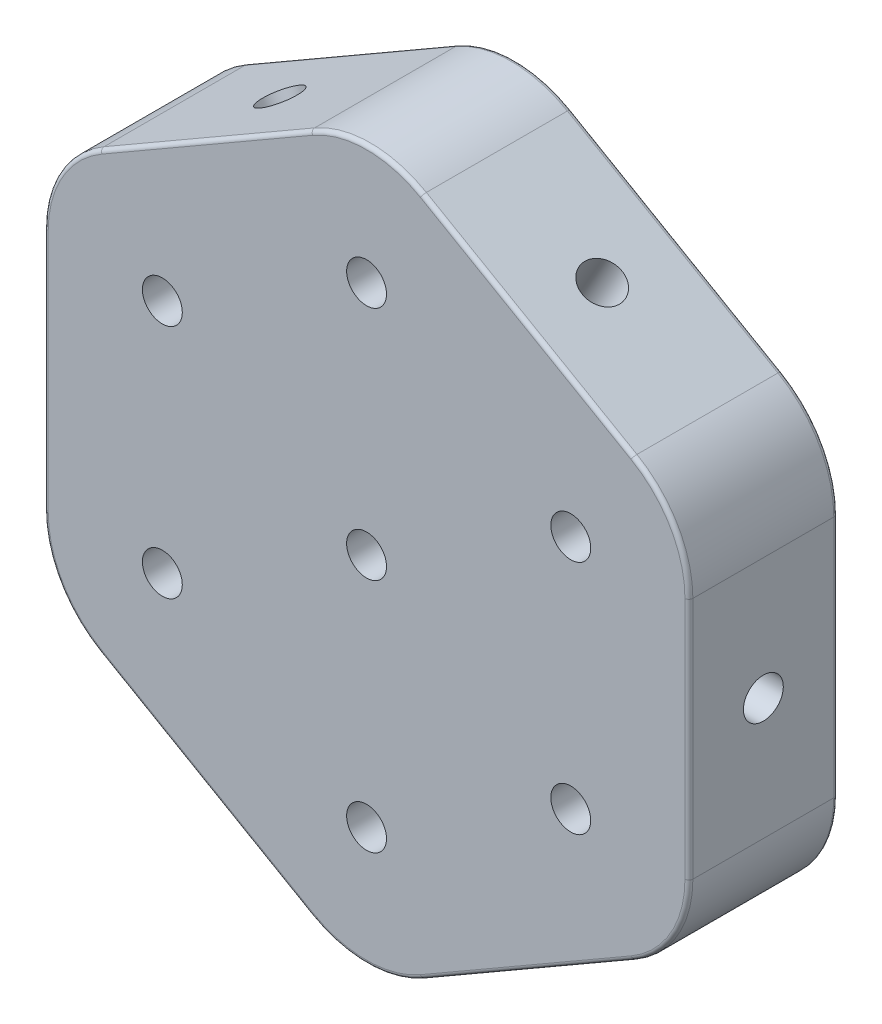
ISO-10303-21;
HEADER;
FILE_DESCRIPTION(('STEP AP214'),'2;1');
FILE_NAME('part.step','',(''),(''),'','','');
FILE_SCHEMA(('AUTOMOTIVE_DESIGN { 1 0 10303 214 1 1 1 1 }'));
ENDSEC;
DATA;
#1=APPLICATION_CONTEXT('core data for automotive mechanical design processes');
#2=APPLICATION_PROTOCOL_DEFINITION('international standard','automotive_design',2000,#1);
#3=PRODUCT_CONTEXT('',#1,'mechanical');
#4=PRODUCT('Part','Part','',(#3));
#5=PRODUCT_RELATED_PRODUCT_CATEGORY('part','',(#4));
#6=PRODUCT_DEFINITION_FORMATION('','',#4);
#7=PRODUCT_DEFINITION_CONTEXT('part definition',#1,'design');
#8=PRODUCT_DEFINITION('design','',#6,#7);
#9=PRODUCT_DEFINITION_SHAPE('','',#8);
#10=(LENGTH_UNIT() NAMED_UNIT(*) SI_UNIT(.MILLI.,.METRE.));
#11=(NAMED_UNIT(*) PLANE_ANGLE_UNIT() SI_UNIT($,.RADIAN.));
#12=(NAMED_UNIT(*) SI_UNIT($,.STERADIAN.) SOLID_ANGLE_UNIT());
#13=UNCERTAINTY_MEASURE_WITH_UNIT(LENGTH_MEASURE(1.E-05),#10,'distance_accuracy_value','');
#14=(GEOMETRIC_REPRESENTATION_CONTEXT(3) GLOBAL_UNCERTAINTY_ASSIGNED_CONTEXT((#13)) GLOBAL_UNIT_ASSIGNED_CONTEXT((#10,
#11,#12)) REPRESENTATION_CONTEXT('',''));
#15=CARTESIAN_POINT('',(0.,0.,0.));
#16=DIRECTION('',(0.,0.,1.));
#17=DIRECTION('',(1.,0.,0.));
#18=AXIS2_PLACEMENT_3D('',#15,#16,#17);
#19=CARTESIAN_POINT('',(41.2496,23.8154676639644,9.525));
#20=DIRECTION('',(-0.5,-0.866025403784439,0.));
#21=DIRECTION('',(0.866025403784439,-0.5,0.));
#22=AXIS2_PLACEMENT_3D('',#19,#20,#21);
#23=PLANE('',#22);
#24=CARTESIAN_POINT('',(20.6248,35.7232014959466,0.));
#25=DIRECTION('',(0.5,0.866025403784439,0.));
#26=DIRECTION('',(-0.866025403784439,0.5,0.));
#27=AXIS2_PLACEMENT_3D('',#24,#25,#26);
#28=CIRCLE('',#27,2.55269999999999);
#29=CARTESIAN_POINT('',(18.4140969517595,36.9995514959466,0.));
#30=VERTEX_POINT('',#29);
#31=EDGE_CURVE('E234',#30,#30,#28,.T.);
#32=ORIENTED_EDGE('',*,*,#31,.F.);
#33=EDGE_LOOP('',(#32));
#34=FACE_BOUND('',#33,.T.);
#35=DIRECTION('',(0.,0.,-1.));
#36=VECTOR('',#35,1.);
#37=CARTESIAN_POINT('',(34.0995,27.9435798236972,9.525));
#38=LINE('',#37,#36);
#39=CARTESIAN_POINT('',(34.0995,27.9435798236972,9.017));
#40=VERTEX_POINT('',#39);
#41=CARTESIAN_POINT('',(34.0995,27.9435798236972,-9.017));
#42=VERTEX_POINT('',#41);
#43=EDGE_CURVE('E285',#40,#42,#38,.T.);
#44=ORIENTED_EDGE('',*,*,#43,.T.);
#45=DIRECTION('',(-0.866025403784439,0.5,0.));
#46=VECTOR('',#45,1.);
#47=CARTESIAN_POINT('',(41.2496,23.8154676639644,-9.017));
#48=LINE('',#47,#46);
#49=CARTESIAN_POINT('',(7.15009999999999,43.502823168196,-9.017));
#50=VERTEX_POINT('',#49);
#51=EDGE_CURVE('E387',#42,#50,#48,.T.);
#52=ORIENTED_EDGE('',*,*,#51,.T.);
#53=DIRECTION('',(0.,0.,-1.));
#54=VECTOR('',#53,1.);
#55=CARTESIAN_POINT('',(7.15009999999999,43.502823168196,9.525));
#56=LINE('',#55,#54);
#57=CARTESIAN_POINT('',(7.15009999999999,43.502823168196,9.017));
#58=VERTEX_POINT('',#57);
#59=EDGE_CURVE('E282',#50,#58,#56,.F.);
#60=ORIENTED_EDGE('',*,*,#59,.T.);
#61=DIRECTION('',(-0.866025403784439,0.5,0.));
#62=VECTOR('',#61,1.);
#63=CARTESIAN_POINT('',(34.0995,27.9435798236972,9.017));
#64=LINE('',#63,#62);
#65=EDGE_CURVE('E385',#58,#40,#64,.F.);
#66=ORIENTED_EDGE('',*,*,#65,.T.);
#67=EDGE_LOOP('',(#44,#52,#60,#66));
#68=FACE_BOUND('',#67,.T.);
#69=ADVANCED_FACE('F16',(#34,#68),#23,.F.);
#70=CARTESIAN_POINT('',(0.,47.6309353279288,9.525));
#71=DIRECTION('',(0.5,-0.866025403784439,0.));
#72=DIRECTION('',(0.866025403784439,0.5,0.));
#73=AXIS2_PLACEMENT_3D('',#70,#71,#72);
#74=PLANE('',#73);
#75=CARTESIAN_POINT('',(-20.6248000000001,35.7232014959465,0.));
#76=DIRECTION('',(-0.500000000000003,0.866025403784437,0.));
#77=DIRECTION('',(-0.866025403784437,-0.500000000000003,0.));
#78=AXIS2_PLACEMENT_3D('',#75,#76,#77);
#79=CIRCLE('',#78,2.55269999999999);
#80=CARTESIAN_POINT('',(-22.8355030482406,34.4468514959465,0.));
#81=VERTEX_POINT('',#80);
#82=EDGE_CURVE('E228',#81,#81,#79,.T.);
#83=ORIENTED_EDGE('',*,*,#82,.F.);
#84=EDGE_LOOP('',(#83));
#85=FACE_BOUND('',#84,.T.);
#86=DIRECTION('',(0.,0.,-1.));
#87=VECTOR('',#86,1.);
#88=CARTESIAN_POINT('',(-7.15010000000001,43.502823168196,9.525));
#89=LINE('',#88,#87);
#90=CARTESIAN_POINT('',(-7.15010000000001,43.502823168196,9.017));
#91=VERTEX_POINT('',#90);
#92=CARTESIAN_POINT('',(-7.15010000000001,43.502823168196,-9.017));
#93=VERTEX_POINT('',#92);
#94=EDGE_CURVE('E312',#91,#93,#89,.T.);
#95=ORIENTED_EDGE('',*,*,#94,.T.);
#96=DIRECTION('',(-0.866025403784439,-0.5,0.));
#97=VECTOR('',#96,1.);
#98=CARTESIAN_POINT('',(0.,47.6309353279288,-9.017));
#99=LINE('',#98,#97);
#100=CARTESIAN_POINT('',(-34.0995,27.9435798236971,-9.017));
#101=VERTEX_POINT('',#100);
#102=EDGE_CURVE('E320',#93,#101,#99,.T.);
#103=ORIENTED_EDGE('',*,*,#102,.T.);
#104=DIRECTION('',(0.,0.,-1.));
#105=VECTOR('',#104,1.);
#106=CARTESIAN_POINT('',(-34.0995,27.9435798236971,9.525));
#107=LINE('',#106,#105);
#108=CARTESIAN_POINT('',(-34.0995,27.9435798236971,9.017));
#109=VERTEX_POINT('',#108);
#110=EDGE_CURVE('E315',#101,#109,#107,.F.);
#111=ORIENTED_EDGE('',*,*,#110,.T.);
#112=DIRECTION('',(-0.866025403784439,-0.5,0.));
#113=VECTOR('',#112,1.);
#114=CARTESIAN_POINT('',(-7.1501,43.502823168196,9.017));
#115=LINE('',#114,#113);
#116=EDGE_CURVE('E318',#109,#91,#115,.F.);
#117=ORIENTED_EDGE('',*,*,#116,.T.);
#118=EDGE_LOOP('',(#95,#103,#111,#117));
#119=FACE_BOUND('',#118,.T.);
#120=ADVANCED_FACE('F588',(#85,#119),#74,.F.);
#121=CARTESIAN_POINT('',(-41.2496,23.8154676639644,9.525));
#122=DIRECTION('',(1.,0.,0.));
#123=DIRECTION('',(0.,1.,0.));
#124=AXIS2_PLACEMENT_3D('',#121,#122,#123);
#125=PLANE('',#124);
#126=CARTESIAN_POINT('',(-41.2496,-2.15105711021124E-13,0.));
#127=DIRECTION('',(-1.,0.,0.));
#128=DIRECTION('',(0.,-1.,0.));
#129=AXIS2_PLACEMENT_3D('',#126,#127,#128);
#130=CIRCLE('',#129,2.55269999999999);
#131=CARTESIAN_POINT('',(-41.2496,-2.55270000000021,0.));
#132=VERTEX_POINT('',#131);
#133=EDGE_CURVE('E222',#132,#132,#130,.T.);
#134=ORIENTED_EDGE('',*,*,#133,.F.);
#135=EDGE_LOOP('',(#134));
#136=FACE_BOUND('',#135,.T.);
#137=DIRECTION('',(0.,0.,-1.));
#138=VECTOR('',#137,1.);
#139=CARTESIAN_POINT('',(-41.2496,15.5592433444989,9.525));
#140=LINE('',#139,#138);
#141=CARTESIAN_POINT('',(-41.2496,15.5592433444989,9.017));
#142=VERTEX_POINT('',#141);
#143=CARTESIAN_POINT('',(-41.2496,15.5592433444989,-9.017));
#144=VERTEX_POINT('',#143);
#145=EDGE_CURVE('E306',#142,#144,#140,.T.);
#146=ORIENTED_EDGE('',*,*,#145,.T.);
#147=DIRECTION('',(0.,-1.,0.));
#148=VECTOR('',#147,1.);
#149=CARTESIAN_POINT('',(-41.2496,23.8154676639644,-9.017));
#150=LINE('',#149,#148);
#151=CARTESIAN_POINT('',(-41.2496,-15.5592433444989,-9.017));
#152=VERTEX_POINT('',#151);
#153=EDGE_CURVE('E354',#144,#152,#150,.T.);
#154=ORIENTED_EDGE('',*,*,#153,.T.);
#155=DIRECTION('',(0.,0.,-1.));
#156=VECTOR('',#155,1.);
#157=CARTESIAN_POINT('',(-41.2496,-15.5592433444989,9.525));
#158=LINE('',#157,#156);
#159=CARTESIAN_POINT('',(-41.2496,-15.5592433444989,9.017));
#160=VERTEX_POINT('',#159);
#161=EDGE_CURVE('E309',#152,#160,#158,.F.);
#162=ORIENTED_EDGE('',*,*,#161,.T.);
#163=DIRECTION('',(0.,-1.,0.));
#164=VECTOR('',#163,1.);
#165=CARTESIAN_POINT('',(-41.2496,15.5592433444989,9.017));
#166=LINE('',#165,#164);
#167=EDGE_CURVE('E352',#160,#142,#166,.F.);
#168=ORIENTED_EDGE('',*,*,#167,.T.);
#169=EDGE_LOOP('',(#146,#154,#162,#168));
#170=FACE_BOUND('',#169,.T.);
#171=ADVANCED_FACE('F494',(#136,#170),#125,.F.);
#172=CARTESIAN_POINT('',(-41.2496,-23.8154676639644,9.525));
#173=DIRECTION('',(0.5,0.866025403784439,0.));
#174=DIRECTION('',(-0.866025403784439,0.5,0.));
#175=AXIS2_PLACEMENT_3D('',#172,#173,#174);
#176=PLANE('',#175);
#177=CARTESIAN_POINT('',(-20.6248,-35.7232014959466,0.));
#178=DIRECTION('',(-0.5,-0.866025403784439,0.));
#179=DIRECTION('',(0.866025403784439,-0.5,0.));
#180=AXIS2_PLACEMENT_3D('',#177,#178,#179);
#181=CIRCLE('',#180,2.55269999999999);
#182=CARTESIAN_POINT('',(-18.4140969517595,-36.9995514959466,0.));
#183=VERTEX_POINT('',#182);
#184=EDGE_CURVE('E216',#183,#183,#181,.T.);
#185=ORIENTED_EDGE('',*,*,#184,.F.);
#186=EDGE_LOOP('',(#185));
#187=FACE_BOUND('',#186,.T.);
#188=DIRECTION('',(0.,0.,-1.));
#189=VECTOR('',#188,1.);
#190=CARTESIAN_POINT('',(-34.0995,-27.9435798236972,9.525));
#191=LINE('',#190,#189);
#192=CARTESIAN_POINT('',(-34.0995,-27.9435798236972,9.017));
#193=VERTEX_POINT('',#192);
#194=CARTESIAN_POINT('',(-34.0995,-27.9435798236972,-9.017));
#195=VERTEX_POINT('',#194);
#196=EDGE_CURVE('E300',#193,#195,#191,.T.);
#197=ORIENTED_EDGE('',*,*,#196,.T.);
#198=DIRECTION('',(0.866025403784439,-0.5,0.));
#199=VECTOR('',#198,1.);
#200=CARTESIAN_POINT('',(-41.2496,-23.8154676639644,-9.017));
#201=LINE('',#200,#199);
#202=CARTESIAN_POINT('',(-7.1501,-43.5028231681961,-9.017));
#203=VERTEX_POINT('',#202);
#204=EDGE_CURVE('E362',#195,#203,#201,.T.);
#205=ORIENTED_EDGE('',*,*,#204,.T.);
#206=DIRECTION('',(0.,0.,-1.));
#207=VECTOR('',#206,1.);
#208=CARTESIAN_POINT('',(-7.1501,-43.5028231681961,9.525));
#209=LINE('',#208,#207);
#210=CARTESIAN_POINT('',(-7.1501,-43.5028231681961,9.017));
#211=VERTEX_POINT('',#210);
#212=EDGE_CURVE('E303',#203,#211,#209,.F.);
#213=ORIENTED_EDGE('',*,*,#212,.T.);
#214=DIRECTION('',(0.866025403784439,-0.5,0.));
#215=VECTOR('',#214,1.);
#216=CARTESIAN_POINT('',(-34.0995,-27.9435798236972,9.017));
#217=LINE('',#216,#215);
#218=EDGE_CURVE('E360',#211,#193,#217,.F.);
#219=ORIENTED_EDGE('',*,*,#218,.T.);
#220=EDGE_LOOP('',(#197,#205,#213,#219));
#221=FACE_BOUND('',#220,.T.);
#222=ADVANCED_FACE('F559',(#187,#221),#176,.F.);
#223=CARTESIAN_POINT('',(0.,-47.6309353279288,9.525));
#224=DIRECTION('',(-0.5,0.866025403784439,0.));
#225=DIRECTION('',(-0.866025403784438,-0.5,0.));
#226=AXIS2_PLACEMENT_3D('',#223,#224,#225);
#227=PLANE('',#226);
#228=CARTESIAN_POINT('',(20.6248000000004,-35.7232014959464,0.));
#229=DIRECTION('',(0.500000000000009,-0.866025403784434,0.));
#230=DIRECTION('',(0.866025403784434,0.500000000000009,0.));
#231=AXIS2_PLACEMENT_3D('',#228,#229,#230);
#232=CIRCLE('',#231,2.55269999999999);
#233=CARTESIAN_POINT('',(22.8355030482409,-34.4468514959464,0.));
#234=VERTEX_POINT('',#233);
#235=EDGE_CURVE('E204',#234,#234,#232,.T.);
#236=ORIENTED_EDGE('',*,*,#235,.F.);
#237=EDGE_LOOP('',(#236));
#238=FACE_BOUND('',#237,.T.);
#239=DIRECTION('',(0.,0.,-1.));
#240=VECTOR('',#239,1.);
#241=CARTESIAN_POINT('',(7.1501,-43.5028231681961,9.525));
#242=LINE('',#241,#240);
#243=CARTESIAN_POINT('',(7.1501,-43.5028231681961,9.017));
#244=VERTEX_POINT('',#243);
#245=CARTESIAN_POINT('',(7.1501,-43.5028231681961,-9.017));
#246=VERTEX_POINT('',#245);
#247=EDGE_CURVE('E294',#244,#246,#242,.T.);
#248=ORIENTED_EDGE('',*,*,#247,.T.);
#249=DIRECTION('',(0.866025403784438,0.5,0.));
#250=VECTOR('',#249,1.);
#251=CARTESIAN_POINT('',(0.,-47.6309353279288,-9.017));
#252=LINE('',#251,#250);
#253=CARTESIAN_POINT('',(34.0995,-27.9435798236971,-9.017));
#254=VERTEX_POINT('',#253);
#255=EDGE_CURVE('E370',#246,#254,#252,.T.);
#256=ORIENTED_EDGE('',*,*,#255,.T.);
#257=DIRECTION('',(0.,0.,-1.));
#258=VECTOR('',#257,1.);
#259=CARTESIAN_POINT('',(34.0995,-27.9435798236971,9.525));
#260=LINE('',#259,#258);
#261=CARTESIAN_POINT('',(34.0995,-27.9435798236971,9.017));
#262=VERTEX_POINT('',#261);
#263=EDGE_CURVE('E297',#254,#262,#260,.F.);
#264=ORIENTED_EDGE('',*,*,#263,.T.);
#265=DIRECTION('',(0.866025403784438,0.5,0.));
#266=VECTOR('',#265,1.);
#267=CARTESIAN_POINT('',(7.1501,-43.5028231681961,9.017));
#268=LINE('',#267,#266);
#269=EDGE_CURVE('E368',#262,#244,#268,.F.);
#270=ORIENTED_EDGE('',*,*,#269,.T.);
#271=EDGE_LOOP('',(#248,#256,#264,#270));
#272=FACE_BOUND('',#271,.T.);
#273=ADVANCED_FACE('F1148',(#238,#272),#227,.F.);
#274=CARTESIAN_POINT('',(41.2496,-23.8154676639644,9.525));
#275=DIRECTION('',(-1.,0.,0.));
#276=DIRECTION('',(0.,-1.,0.));
#277=AXIS2_PLACEMENT_3D('',#274,#275,#276);
#278=PLANE('',#277);
#279=CARTESIAN_POINT('',(41.2496,5.06539254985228E-13,0.));
#280=DIRECTION('',(1.,0.,0.));
#281=DIRECTION('',(0.,1.,0.));
#282=AXIS2_PLACEMENT_3D('',#279,#280,#281);
#283=CIRCLE('',#282,2.55269999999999);
#284=CARTESIAN_POINT('',(41.2496,2.5527000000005,0.));
#285=VERTEX_POINT('',#284);
#286=EDGE_CURVE('E205',#285,#285,#283,.T.);
#287=ORIENTED_EDGE('',*,*,#286,.F.);
#288=EDGE_LOOP('',(#287));
#289=FACE_BOUND('',#288,.T.);
#290=DIRECTION('',(0.,0.,-1.));
#291=VECTOR('',#290,1.);
#292=CARTESIAN_POINT('',(41.2496,-15.5592433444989,9.525));
#293=LINE('',#292,#291);
#294=CARTESIAN_POINT('',(41.2496,-15.5592433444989,9.017));
#295=VERTEX_POINT('',#294);
#296=CARTESIAN_POINT('',(41.2496,-15.5592433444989,-9.017));
#297=VERTEX_POINT('',#296);
#298=EDGE_CURVE('E288',#295,#297,#293,.T.);
#299=ORIENTED_EDGE('',*,*,#298,.T.);
#300=DIRECTION('',(0.,1.,0.));
#301=VECTOR('',#300,1.);
#302=CARTESIAN_POINT('',(41.2496,-23.8154676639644,-9.017));
#303=LINE('',#302,#301);
#304=CARTESIAN_POINT('',(41.2496,15.5592433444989,-9.017));
#305=VERTEX_POINT('',#304);
#306=EDGE_CURVE('E378',#297,#305,#303,.T.);
#307=ORIENTED_EDGE('',*,*,#306,.T.);
#308=DIRECTION('',(0.,0.,-1.));
#309=VECTOR('',#308,1.);
#310=CARTESIAN_POINT('',(41.2496,15.5592433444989,9.525));
#311=LINE('',#310,#309);
#312=CARTESIAN_POINT('',(41.2496,15.5592433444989,9.017));
#313=VERTEX_POINT('',#312);
#314=EDGE_CURVE('E291',#305,#313,#311,.F.);
#315=ORIENTED_EDGE('',*,*,#314,.T.);
#316=DIRECTION('',(0.,1.,0.));
#317=VECTOR('',#316,1.);
#318=CARTESIAN_POINT('',(41.2496,-15.5592433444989,9.017));
#319=LINE('',#318,#317);
#320=EDGE_CURVE('E376',#313,#295,#319,.F.);
#321=ORIENTED_EDGE('',*,*,#320,.T.);
#322=EDGE_LOOP('',(#299,#307,#315,#321));
#323=FACE_BOUND('',#322,.T.);
#324=ADVANCED_FACE('F621',(#289,#323),#278,.F.);
#325=CARTESIAN_POINT('',(0.,0.,9.525));
#326=DIRECTION('',(0.,0.,1.));
#327=DIRECTION('',(1.,0.,0.));
#328=AXIS2_PLACEMENT_3D('',#325,#326,#327);
#329=PLANE('',#328);
#330=DIRECTION('',(0.,1.,0.));
#331=VECTOR('',#330,1.);
#332=CARTESIAN_POINT('',(40.7416,15.5592433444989,9.525));
#333=LINE('',#332,#331);
#334=CARTESIAN_POINT('',(40.7416,-15.5592433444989,9.525));
#335=VERTEX_POINT('',#334);
#336=CARTESIAN_POINT('',(40.7416,15.5592433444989,9.525));
#337=VERTEX_POINT('',#336);
#338=EDGE_CURVE('E33',#335,#337,#333,.T.);
#339=ORIENTED_EDGE('',*,*,#338,.T.);
#340=CARTESIAN_POINT('',(26.9494,15.5592433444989,9.525));
#341=DIRECTION('',(0.,0.,1.));
#342=DIRECTION('',(1.,0.,0.));
#343=AXIS2_PLACEMENT_3D('',#340,#341,#342);
#344=CIRCLE('',#343,13.7922);
#345=CARTESIAN_POINT('',(33.8455,27.5036389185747,9.525));
#346=VERTEX_POINT('',#345);
#347=EDGE_CURVE('E409',#337,#346,#344,.T.);
#348=ORIENTED_EDGE('',*,*,#347,.T.);
#349=DIRECTION('',(-0.866025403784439,0.5,0.));
#350=VECTOR('',#349,1.);
#351=CARTESIAN_POINT('',(6.89609999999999,43.0628822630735,9.525));
#352=LINE('',#351,#350);
#353=CARTESIAN_POINT('',(6.89609999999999,43.0628822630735,9.525));
#354=VERTEX_POINT('',#353);
#355=EDGE_CURVE('E389',#346,#354,#352,.T.);
#356=ORIENTED_EDGE('',*,*,#355,.T.);
#357=CARTESIAN_POINT('',(0.,31.1184866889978,9.525));
#358=DIRECTION('',(0.,0.,1.));
#359=DIRECTION('',(1.,0.,0.));
#360=AXIS2_PLACEMENT_3D('',#357,#358,#359);
#361=CIRCLE('',#360,13.7922);
#362=CARTESIAN_POINT('',(-6.89610000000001,43.0628822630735,9.525));
#363=VERTEX_POINT('',#362);
#364=EDGE_CURVE('E391',#354,#363,#361,.T.);
#365=ORIENTED_EDGE('',*,*,#364,.T.);
#366=DIRECTION('',(-0.866025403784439,-0.5,0.));
#367=VECTOR('',#366,1.);
#368=CARTESIAN_POINT('',(-33.8455,27.5036389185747,9.525));
#369=LINE('',#368,#367);
#370=CARTESIAN_POINT('',(-33.8455,27.5036389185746,9.525));
#371=VERTEX_POINT('',#370);
#372=EDGE_CURVE('E393',#363,#371,#369,.T.);
#373=ORIENTED_EDGE('',*,*,#372,.T.);
#374=CARTESIAN_POINT('',(-26.9494,15.5592433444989,9.525));
#375=DIRECTION('',(0.,0.,1.));
#376=DIRECTION('',(1.,0.,0.));
#377=AXIS2_PLACEMENT_3D('',#374,#375,#376);
#378=CIRCLE('',#377,13.7922);
#379=CARTESIAN_POINT('',(-40.7416,15.5592433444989,9.525));
#380=VERTEX_POINT('',#379);
#381=EDGE_CURVE('E395',#371,#380,#378,.T.);
#382=ORIENTED_EDGE('',*,*,#381,.T.);
#383=DIRECTION('',(0.,-1.,0.));
#384=VECTOR('',#383,1.);
#385=CARTESIAN_POINT('',(-40.7416,-15.5592433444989,9.525));
#386=LINE('',#385,#384);
#387=CARTESIAN_POINT('',(-40.7416,-15.5592433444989,9.525));
#388=VERTEX_POINT('',#387);
#389=EDGE_CURVE('E397',#380,#388,#386,.T.);
#390=ORIENTED_EDGE('',*,*,#389,.T.);
#391=CARTESIAN_POINT('',(-26.9494,-15.5592433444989,9.525));
#392=DIRECTION('',(0.,0.,1.));
#393=DIRECTION('',(1.,0.,0.));
#394=AXIS2_PLACEMENT_3D('',#391,#392,#393);
#395=CIRCLE('',#394,13.7922);
#396=CARTESIAN_POINT('',(-33.8455,-27.5036389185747,9.525));
#397=VERTEX_POINT('',#396);
#398=EDGE_CURVE('E399',#388,#397,#395,.T.);
#399=ORIENTED_EDGE('',*,*,#398,.T.);
#400=DIRECTION('',(0.866025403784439,-0.5,0.));
#401=VECTOR('',#400,1.);
#402=CARTESIAN_POINT('',(-6.8961,-43.0628822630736,9.525));
#403=LINE('',#402,#401);
#404=CARTESIAN_POINT('',(-6.8961,-43.0628822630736,9.525));
#405=VERTEX_POINT('',#404);
#406=EDGE_CURVE('E401',#397,#405,#403,.T.);
#407=ORIENTED_EDGE('',*,*,#406,.T.);
#408=CARTESIAN_POINT('',(0.,-31.1184866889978,9.525));
#409=DIRECTION('',(0.,0.,1.));
#410=DIRECTION('',(1.,0.,0.));
#411=AXIS2_PLACEMENT_3D('',#408,#409,#410);
#412=CIRCLE('',#411,13.7922);
#413=CARTESIAN_POINT('',(6.8961,-43.0628822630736,9.525));
#414=VERTEX_POINT('',#413);
#415=EDGE_CURVE('E403',#405,#414,#412,.T.);
#416=ORIENTED_EDGE('',*,*,#415,.T.);
#417=DIRECTION('',(0.866025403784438,0.5,0.));
#418=VECTOR('',#417,1.);
#419=CARTESIAN_POINT('',(33.8455,-27.5036389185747,9.525));
#420=LINE('',#419,#418);
#421=CARTESIAN_POINT('',(33.8455,-27.5036389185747,9.525));
#422=VERTEX_POINT('',#421);
#423=EDGE_CURVE('E405',#414,#422,#420,.T.);
#424=ORIENTED_EDGE('',*,*,#423,.T.);
#425=CARTESIAN_POINT('',(26.9494,-15.5592433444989,9.525));
#426=DIRECTION('',(0.,0.,1.));
#427=DIRECTION('',(1.,0.,0.));
#428=AXIS2_PLACEMENT_3D('',#425,#426,#427);
#429=CIRCLE('',#428,13.7922);
#430=EDGE_CURVE('E38',#422,#335,#429,.T.);
#431=ORIENTED_EDGE('',*,*,#430,.T.);
#432=EDGE_LOOP('',(#339,#348,#356,#365,#373,#382,#390,#399,#407,#416,#424,#431));
#433=FACE_BOUND('',#432,.T.);
#434=CARTESIAN_POINT('',(-26.1324897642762,15.0875999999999,9.525));
#435=DIRECTION('',(0.,0.,1.));
#436=DIRECTION('',(1.,0.,0.));
#437=AXIS2_PLACEMENT_3D('',#434,#435,#436);
#438=CIRCLE('',#437,2.55269999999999);
#439=CARTESIAN_POINT('',(-23.5797897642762,15.0875999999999,9.525));
#440=VERTEX_POINT('',#439);
#441=EDGE_CURVE('E240',#440,#440,#438,.T.);
#442=ORIENTED_EDGE('',*,*,#441,.F.);
#443=EDGE_LOOP('',(#442));
#444=FACE_BOUND('',#443,.T.);
#445=CARTESIAN_POINT('',(-26.1324897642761,-15.0876000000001,9.525));
#446=DIRECTION('',(0.,0.,1.));
#447=DIRECTION('',(1.,0.,0.));
#448=AXIS2_PLACEMENT_3D('',#445,#446,#447);
#449=CIRCLE('',#448,2.55269999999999);
#450=CARTESIAN_POINT('',(-23.5797897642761,-15.0876000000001,9.525));
#451=VERTEX_POINT('',#450);
#452=EDGE_CURVE('E246',#451,#451,#449,.T.);
#453=ORIENTED_EDGE('',*,*,#452,.F.);
#454=EDGE_LOOP('',(#453));
#455=FACE_BOUND('',#454,.T.);
#456=CARTESIAN_POINT('',(0.,-30.1752,9.525));
#457=DIRECTION('',(0.,0.,1.));
#458=DIRECTION('',(1.,0.,0.));
#459=AXIS2_PLACEMENT_3D('',#456,#457,#458);
#460=CIRCLE('',#459,2.55269999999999);
#461=CARTESIAN_POINT('',(2.55269999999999,-30.1752,9.525));
#462=VERTEX_POINT('',#461);
#463=EDGE_CURVE('E252',#462,#462,#460,.T.);
#464=ORIENTED_EDGE('',*,*,#463,.F.);
#465=EDGE_LOOP('',(#464));
#466=FACE_BOUND('',#465,.T.);
#467=CARTESIAN_POINT('',(26.1324897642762,-15.0875999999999,9.525));
#468=DIRECTION('',(0.,0.,1.));
#469=DIRECTION('',(1.,0.,0.));
#470=AXIS2_PLACEMENT_3D('',#467,#468,#469);
#471=CIRCLE('',#470,2.55269999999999);
#472=CARTESIAN_POINT('',(28.6851897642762,-15.0875999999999,9.525));
#473=VERTEX_POINT('',#472);
#474=EDGE_CURVE('E258',#473,#473,#471,.T.);
#475=ORIENTED_EDGE('',*,*,#474,.F.);
#476=EDGE_LOOP('',(#475));
#477=FACE_BOUND('',#476,.T.);
#478=CARTESIAN_POINT('',(26.1324897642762,15.0876,9.525));
#479=DIRECTION('',(0.,0.,1.));
#480=DIRECTION('',(1.,0.,0.));
#481=AXIS2_PLACEMENT_3D('',#478,#479,#480);
#482=CIRCLE('',#481,2.55269999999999);
#483=CARTESIAN_POINT('',(28.6851897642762,15.0876,9.525));
#484=VERTEX_POINT('',#483);
#485=EDGE_CURVE('E264',#484,#484,#482,.T.);
#486=ORIENTED_EDGE('',*,*,#485,.F.);
#487=EDGE_LOOP('',(#486));
#488=FACE_BOUND('',#487,.T.);
#489=CARTESIAN_POINT('',(0.,30.1752,9.525));
#490=DIRECTION('',(0.,0.,1.));
#491=DIRECTION('',(1.,0.,0.));
#492=AXIS2_PLACEMENT_3D('',#489,#490,#491);
#493=CIRCLE('',#492,2.55269999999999);
#494=CARTESIAN_POINT('',(2.55269999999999,30.1752,9.525));
#495=VERTEX_POINT('',#494);
#496=EDGE_CURVE('E270',#495,#495,#493,.T.);
#497=ORIENTED_EDGE('',*,*,#496,.F.);
#498=EDGE_LOOP('',(#497));
#499=FACE_BOUND('',#498,.T.);
#500=CARTESIAN_POINT('',(0.,0.,9.525));
#501=DIRECTION('',(0.,0.,1.));
#502=DIRECTION('',(1.,0.,0.));
#503=AXIS2_PLACEMENT_3D('',#500,#501,#502);
#504=CIRCLE('',#503,2.55269999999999);
#505=CARTESIAN_POINT('',(2.55269999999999,0.,9.525));
#506=VERTEX_POINT('',#505);
#507=EDGE_CURVE('E276',#506,#506,#504,.T.);
#508=ORIENTED_EDGE('',*,*,#507,.F.);
#509=EDGE_LOOP('',(#508));
#510=FACE_BOUND('',#509,.T.);
#511=ADVANCED_FACE('F574',(#433,#444,#455,#466,#477,#488,#499,#510),#329,.T.);
#512=CARTESIAN_POINT('',(0.,0.,-9.525));
#513=DIRECTION('',(0.,0.,1.));
#514=DIRECTION('',(1.,0.,0.));
#515=AXIS2_PLACEMENT_3D('',#512,#513,#514);
#516=PLANE('',#515);
#517=CARTESIAN_POINT('',(-26.9494,15.5592433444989,-9.525));
#518=DIRECTION('',(0.,0.,1.));
#519=DIRECTION('',(1.,0.,0.));
#520=AXIS2_PLACEMENT_3D('',#517,#518,#519);
#521=CIRCLE('',#520,13.7922);
#522=CARTESIAN_POINT('',(-40.7416,15.5592433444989,-9.525));
#523=VERTEX_POINT('',#522);
#524=CARTESIAN_POINT('',(-33.8455,27.5036389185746,-9.525));
#525=VERTEX_POINT('',#524);
#526=EDGE_CURVE('E343',#523,#525,#521,.F.);
#527=ORIENTED_EDGE('',*,*,#526,.T.);
#528=DIRECTION('',(-0.866025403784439,-0.5,0.));
#529=VECTOR('',#528,1.);
#530=CARTESIAN_POINT('',(-20.3708,35.2832605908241,-9.525));
#531=LINE('',#530,#529);
#532=CARTESIAN_POINT('',(-6.8961,43.0628822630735,-9.525));
#533=VERTEX_POINT('',#532);
#534=EDGE_CURVE('E345',#525,#533,#531,.F.);
#535=ORIENTED_EDGE('',*,*,#534,.T.);
#536=CARTESIAN_POINT('',(0.,31.1184866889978,-9.525));
#537=DIRECTION('',(0.,0.,1.));
#538=DIRECTION('',(1.,0.,0.));
#539=AXIS2_PLACEMENT_3D('',#536,#537,#538);
#540=CIRCLE('',#539,13.7922);
#541=CARTESIAN_POINT('',(6.89609999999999,43.0628822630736,-9.525));
#542=VERTEX_POINT('',#541);
#543=EDGE_CURVE('E323',#533,#542,#540,.F.);
#544=ORIENTED_EDGE('',*,*,#543,.T.);
#545=DIRECTION('',(-0.866025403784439,0.5,0.));
#546=VECTOR('',#545,1.);
#547=CARTESIAN_POINT('',(20.3708,35.2832605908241,-9.525));
#548=LINE('',#547,#546);
#549=CARTESIAN_POINT('',(33.8455,27.5036389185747,-9.525));
#550=VERTEX_POINT('',#549);
#551=EDGE_CURVE('E325',#542,#550,#548,.F.);
#552=ORIENTED_EDGE('',*,*,#551,.T.);
#553=CARTESIAN_POINT('',(26.9494,15.5592433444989,-9.525));
#554=DIRECTION('',(0.,0.,1.));
#555=DIRECTION('',(1.,0.,0.));
#556=AXIS2_PLACEMENT_3D('',#553,#554,#555);
#557=CIRCLE('',#556,13.7922);
#558=CARTESIAN_POINT('',(40.7416,15.5592433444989,-9.525));
#559=VERTEX_POINT('',#558);
#560=EDGE_CURVE('E327',#550,#559,#557,.F.);
#561=ORIENTED_EDGE('',*,*,#560,.T.);
#562=DIRECTION('',(0.,1.,0.));
#563=VECTOR('',#562,1.);
#564=CARTESIAN_POINT('',(40.7416,0.,-9.525));
#565=LINE('',#564,#563);
#566=CARTESIAN_POINT('',(40.7416,-15.5592433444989,-9.525));
#567=VERTEX_POINT('',#566);
#568=EDGE_CURVE('E329',#559,#567,#565,.F.);
#569=ORIENTED_EDGE('',*,*,#568,.T.);
#570=CARTESIAN_POINT('',(26.9494,-15.5592433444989,-9.525));
#571=DIRECTION('',(0.,0.,1.));
#572=DIRECTION('',(1.,0.,0.));
#573=AXIS2_PLACEMENT_3D('',#570,#571,#572);
#574=CIRCLE('',#573,13.7922);
#575=CARTESIAN_POINT('',(33.8455,-27.5036389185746,-9.525));
#576=VERTEX_POINT('',#575);
#577=EDGE_CURVE('E331',#567,#576,#574,.F.);
#578=ORIENTED_EDGE('',*,*,#577,.T.);
#579=DIRECTION('',(0.866025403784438,0.5,0.));
#580=VECTOR('',#579,1.);
#581=CARTESIAN_POINT('',(20.3708,-35.2832605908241,-9.525));
#582=LINE('',#581,#580);
#583=CARTESIAN_POINT('',(6.8961,-43.0628822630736,-9.525));
#584=VERTEX_POINT('',#583);
#585=EDGE_CURVE('E333',#576,#584,#582,.F.);
#586=ORIENTED_EDGE('',*,*,#585,.T.);
#587=CARTESIAN_POINT('',(0.,-31.1184866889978,-9.525));
#588=DIRECTION('',(0.,0.,1.));
#589=DIRECTION('',(1.,0.,0.));
#590=AXIS2_PLACEMENT_3D('',#587,#588,#589);
#591=CIRCLE('',#590,13.7922);
#592=CARTESIAN_POINT('',(-6.8961,-43.0628822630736,-9.525));
#593=VERTEX_POINT('',#592);
#594=EDGE_CURVE('E335',#584,#593,#591,.F.);
#595=ORIENTED_EDGE('',*,*,#594,.T.);
#596=DIRECTION('',(0.866025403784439,-0.5,0.));
#597=VECTOR('',#596,1.);
#598=CARTESIAN_POINT('',(-20.3708,-35.2832605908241,-9.525));
#599=LINE('',#598,#597);
#600=CARTESIAN_POINT('',(-33.8455,-27.5036389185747,-9.525));
#601=VERTEX_POINT('',#600);
#602=EDGE_CURVE('E337',#593,#601,#599,.F.);
#603=ORIENTED_EDGE('',*,*,#602,.T.);
#604=CARTESIAN_POINT('',(-26.9494,-15.5592433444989,-9.525));
#605=DIRECTION('',(0.,0.,1.));
#606=DIRECTION('',(1.,0.,0.));
#607=AXIS2_PLACEMENT_3D('',#604,#605,#606);
#608=CIRCLE('',#607,13.7922);
#609=CARTESIAN_POINT('',(-40.7416,-15.5592433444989,-9.525));
#610=VERTEX_POINT('',#609);
#611=EDGE_CURVE('E339',#601,#610,#608,.F.);
#612=ORIENTED_EDGE('',*,*,#611,.T.);
#613=DIRECTION('',(0.,-1.,0.));
#614=VECTOR('',#613,1.);
#615=CARTESIAN_POINT('',(-40.7416,0.,-9.525));
#616=LINE('',#615,#614);
#617=EDGE_CURVE('E341',#610,#523,#616,.F.);
#618=ORIENTED_EDGE('',*,*,#617,.T.);
#619=EDGE_LOOP('',(#527,#535,#544,#552,#561,#569,#578,#586,#595,#603,#612,#618));
#620=FACE_BOUND('',#619,.T.);
#621=CARTESIAN_POINT('',(-26.1324897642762,15.0875999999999,-9.525));
#622=DIRECTION('',(0.,0.,1.));
#623=DIRECTION('',(1.,0.,0.));
#624=AXIS2_PLACEMENT_3D('',#621,#622,#623);
#625=CIRCLE('',#624,2.55269999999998);
#626=CARTESIAN_POINT('',(-23.5797897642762,15.0875999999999,-9.525));
#627=VERTEX_POINT('',#626);
#628=EDGE_CURVE('E243',#627,#627,#625,.T.);
#629=ORIENTED_EDGE('',*,*,#628,.T.);
#630=EDGE_LOOP('',(#629));
#631=FACE_BOUND('',#630,.T.);
#632=CARTESIAN_POINT('',(-26.1324897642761,-15.0876000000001,-9.525));
#633=DIRECTION('',(0.,0.,1.));
#634=DIRECTION('',(1.,0.,0.));
#635=AXIS2_PLACEMENT_3D('',#632,#633,#634);
#636=CIRCLE('',#635,2.55269999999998);
#637=CARTESIAN_POINT('',(-23.5797897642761,-15.0876000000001,-9.525));
#638=VERTEX_POINT('',#637);
#639=EDGE_CURVE('E249',#638,#638,#636,.T.);
#640=ORIENTED_EDGE('',*,*,#639,.T.);
#641=EDGE_LOOP('',(#640));
#642=FACE_BOUND('',#641,.T.);
#643=CARTESIAN_POINT('',(0.,-30.1752,-9.525));
#644=DIRECTION('',(0.,0.,1.));
#645=DIRECTION('',(1.,0.,0.));
#646=AXIS2_PLACEMENT_3D('',#643,#644,#645);
#647=CIRCLE('',#646,2.55269999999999);
#648=CARTESIAN_POINT('',(2.55269999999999,-30.1752,-9.525));
#649=VERTEX_POINT('',#648);
#650=EDGE_CURVE('E255',#649,#649,#647,.T.);
#651=ORIENTED_EDGE('',*,*,#650,.T.);
#652=EDGE_LOOP('',(#651));
#653=FACE_BOUND('',#652,.T.);
#654=CARTESIAN_POINT('',(26.1324897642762,-15.0875999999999,-9.525));
#655=DIRECTION('',(0.,0.,1.));
#656=DIRECTION('',(1.,0.,0.));
#657=AXIS2_PLACEMENT_3D('',#654,#655,#656);
#658=CIRCLE('',#657,2.55269999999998);
#659=CARTESIAN_POINT('',(28.6851897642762,-15.0875999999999,-9.525));
#660=VERTEX_POINT('',#659);
#661=EDGE_CURVE('E261',#660,#660,#658,.T.);
#662=ORIENTED_EDGE('',*,*,#661,.T.);
#663=EDGE_LOOP('',(#662));
#664=FACE_BOUND('',#663,.T.);
#665=CARTESIAN_POINT('',(26.1324897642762,15.0876,-9.525));
#666=DIRECTION('',(0.,0.,1.));
#667=DIRECTION('',(1.,0.,0.));
#668=AXIS2_PLACEMENT_3D('',#665,#666,#667);
#669=CIRCLE('',#668,2.55269999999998);
#670=CARTESIAN_POINT('',(28.6851897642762,15.0876,-9.525));
#671=VERTEX_POINT('',#670);
#672=EDGE_CURVE('E267',#671,#671,#669,.T.);
#673=ORIENTED_EDGE('',*,*,#672,.T.);
#674=EDGE_LOOP('',(#673));
#675=FACE_BOUND('',#674,.T.);
#676=CARTESIAN_POINT('',(0.,30.1752,-9.525));
#677=DIRECTION('',(0.,0.,1.));
#678=DIRECTION('',(1.,0.,0.));
#679=AXIS2_PLACEMENT_3D('',#676,#677,#678);
#680=CIRCLE('',#679,2.55269999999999);
#681=CARTESIAN_POINT('',(2.55269999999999,30.1752,-9.525));
#682=VERTEX_POINT('',#681);
#683=EDGE_CURVE('E273',#682,#682,#680,.T.);
#684=ORIENTED_EDGE('',*,*,#683,.T.);
#685=EDGE_LOOP('',(#684));
#686=FACE_BOUND('',#685,.T.);
#687=CARTESIAN_POINT('',(0.,0.,-9.525));
#688=DIRECTION('',(0.,0.,1.));
#689=DIRECTION('',(1.,0.,0.));
#690=AXIS2_PLACEMENT_3D('',#687,#688,#689);
#691=CIRCLE('',#690,2.55269999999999);
#692=CARTESIAN_POINT('',(2.55269999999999,0.,-9.525));
#693=VERTEX_POINT('',#692);
#694=EDGE_CURVE('E279',#693,#693,#691,.T.);
#695=ORIENTED_EDGE('',*,*,#694,.T.);
#696=EDGE_LOOP('',(#695));
#697=FACE_BOUND('',#696,.T.);
#698=ADVANCED_FACE('F509',(#620,#631,#642,#653,#664,#675,#686,#697),#516,.F.);
#699=CARTESIAN_POINT('',(0.,0.,9.525));
#700=DIRECTION('',(0.,0.,1.));
#701=DIRECTION('',(1.,0.,0.));
#702=AXIS2_PLACEMENT_3D('',#699,#700,#701);
#703=CYLINDRICAL_SURFACE('',#702,2.55269999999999);
#704=ORIENTED_EDGE('',*,*,#694,.F.);
#705=EDGE_LOOP('',(#704));
#706=FACE_BOUND('',#705,.T.);
#707=ORIENTED_EDGE('',*,*,#507,.T.);
#708=EDGE_LOOP('',(#707));
#709=FACE_BOUND('',#708,.T.);
#710=ADVANCED_FACE('F1109',(#706,#709),#703,.F.);
#711=CARTESIAN_POINT('',(0.,30.1752,9.525));
#712=DIRECTION('',(0.,0.,1.));
#713=DIRECTION('',(1.,0.,0.));
#714=AXIS2_PLACEMENT_3D('',#711,#712,#713);
#715=CYLINDRICAL_SURFACE('',#714,2.55269999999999);
#716=ORIENTED_EDGE('',*,*,#683,.F.);
#717=EDGE_LOOP('',(#716));
#718=FACE_BOUND('',#717,.T.);
#719=ORIENTED_EDGE('',*,*,#496,.T.);
#720=EDGE_LOOP('',(#719));
#721=FACE_BOUND('',#720,.T.);
#722=ADVANCED_FACE('F1098',(#718,#721),#715,.F.);
#723=CARTESIAN_POINT('',(26.1324897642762,15.0876,9.525));
#724=DIRECTION('',(0.,0.,1.));
#725=DIRECTION('',(1.,0.,0.));
#726=AXIS2_PLACEMENT_3D('',#723,#724,#725);
#727=CYLINDRICAL_SURFACE('',#726,2.55269999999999);
#728=ORIENTED_EDGE('',*,*,#672,.F.);
#729=EDGE_LOOP('',(#728));
#730=FACE_BOUND('',#729,.T.);
#731=ORIENTED_EDGE('',*,*,#485,.T.);
#732=EDGE_LOOP('',(#731));
#733=FACE_BOUND('',#732,.T.);
#734=ADVANCED_FACE('F1087',(#730,#733),#727,.F.);
#735=CARTESIAN_POINT('',(26.1324897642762,-15.0875999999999,9.525));
#736=DIRECTION('',(0.,0.,1.));
#737=DIRECTION('',(1.,0.,0.));
#738=AXIS2_PLACEMENT_3D('',#735,#736,#737);
#739=CYLINDRICAL_SURFACE('',#738,2.55269999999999);
#740=ORIENTED_EDGE('',*,*,#661,.F.);
#741=EDGE_LOOP('',(#740));
#742=FACE_BOUND('',#741,.T.);
#743=ORIENTED_EDGE('',*,*,#474,.T.);
#744=EDGE_LOOP('',(#743));
#745=FACE_BOUND('',#744,.T.);
#746=ADVANCED_FACE('F1076',(#742,#745),#739,.F.);
#747=CARTESIAN_POINT('',(0.,-30.1752,9.525));
#748=DIRECTION('',(0.,0.,1.));
#749=DIRECTION('',(1.,0.,0.));
#750=AXIS2_PLACEMENT_3D('',#747,#748,#749);
#751=CYLINDRICAL_SURFACE('',#750,2.55269999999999);
#752=ORIENTED_EDGE('',*,*,#650,.F.);
#753=EDGE_LOOP('',(#752));
#754=FACE_BOUND('',#753,.T.);
#755=ORIENTED_EDGE('',*,*,#463,.T.);
#756=EDGE_LOOP('',(#755));
#757=FACE_BOUND('',#756,.T.);
#758=ADVANCED_FACE('F1065',(#754,#757),#751,.F.);
#759=CARTESIAN_POINT('',(-26.1324897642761,-15.0876000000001,9.525));
#760=DIRECTION('',(0.,0.,1.));
#761=DIRECTION('',(1.,0.,0.));
#762=AXIS2_PLACEMENT_3D('',#759,#760,#761);
#763=CYLINDRICAL_SURFACE('',#762,2.55269999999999);
#764=ORIENTED_EDGE('',*,*,#639,.F.);
#765=EDGE_LOOP('',(#764));
#766=FACE_BOUND('',#765,.T.);
#767=ORIENTED_EDGE('',*,*,#452,.T.);
#768=EDGE_LOOP('',(#767));
#769=FACE_BOUND('',#768,.T.);
#770=ADVANCED_FACE('F1054',(#766,#769),#763,.F.);
#771=CARTESIAN_POINT('',(-26.1324897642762,15.0875999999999,9.525));
#772=DIRECTION('',(0.,0.,1.));
#773=DIRECTION('',(1.,0.,0.));
#774=AXIS2_PLACEMENT_3D('',#771,#772,#773);
#775=CYLINDRICAL_SURFACE('',#774,2.55269999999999);
#776=ORIENTED_EDGE('',*,*,#628,.F.);
#777=EDGE_LOOP('',(#776));
#778=FACE_BOUND('',#777,.T.);
#779=ORIENTED_EDGE('',*,*,#441,.T.);
#780=EDGE_LOOP('',(#779));
#781=FACE_BOUND('',#780,.T.);
#782=ADVANCED_FACE('F1043',(#778,#781),#775,.F.);
#783=CARTESIAN_POINT('',(11.0998,19.2254175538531,0.));
#784=DIRECTION('',(0.5,0.866025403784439,0.));
#785=DIRECTION('',(-0.866025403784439,0.5,0.));
#786=AXIS2_PLACEMENT_3D('',#783,#784,#785);
#787=CONICAL_SURFACE('',#786,2.55269999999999,1.02974425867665);
#788=CARTESIAN_POINT('',(10.3328915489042,17.8970931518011,0.));
#789=VERTEX_POINT('',#788);
#790=VERTEX_LOOP('',#789);
#791=FACE_BOUND('',#790,.T.);
#792=CARTESIAN_POINT('',(11.0998,19.2254175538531,0.));
#793=DIRECTION('',(0.5,0.866025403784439,0.));
#794=DIRECTION('',(-0.866025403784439,0.5,0.));
#795=AXIS2_PLACEMENT_3D('',#792,#793,#794);
#796=CIRCLE('',#795,2.55269999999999);
#797=CARTESIAN_POINT('',(8.88909695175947,20.501767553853,0.));
#798=VERTEX_POINT('',#797);
#799=EDGE_CURVE('E237',#798,#798,#796,.T.);
#800=ORIENTED_EDGE('',*,*,#799,.T.);
#801=EDGE_LOOP('',(#800));
#802=FACE_BOUND('',#801,.T.);
#803=ADVANCED_FACE('F1032',(#791,#802),#787,.F.);
#804=CARTESIAN_POINT('',(20.6248,35.7232014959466,0.));
#805=DIRECTION('',(0.5,0.866025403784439,0.));
#806=DIRECTION('',(-0.866025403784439,0.5,0.));
#807=AXIS2_PLACEMENT_3D('',#804,#805,#806);
#808=CYLINDRICAL_SURFACE('',#807,2.55269999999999);
#809=ORIENTED_EDGE('',*,*,#799,.F.);
#810=EDGE_LOOP('',(#809));
#811=FACE_BOUND('',#810,.T.);
#812=ORIENTED_EDGE('',*,*,#31,.T.);
#813=EDGE_LOOP('',(#812));
#814=FACE_BOUND('',#813,.T.);
#815=ADVANCED_FACE('F1021',(#811,#814),#808,.F.);
#816=CARTESIAN_POINT('',(-11.0998000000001,19.225417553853,0.));
#817=DIRECTION('',(-0.500000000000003,0.866025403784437,0.));
#818=DIRECTION('',(-0.866025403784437,-0.500000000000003,0.));
#819=AXIS2_PLACEMENT_3D('',#816,#817,#818);
#820=CONICAL_SURFACE('',#819,2.55269999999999,1.02974425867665);
#821=CARTESIAN_POINT('',(-10.3328915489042,17.8970931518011,0.));
#822=VERTEX_POINT('',#821);
#823=VERTEX_LOOP('',#822);
#824=FACE_BOUND('',#823,.T.);
#825=CARTESIAN_POINT('',(-11.0998000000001,19.225417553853,0.));
#826=DIRECTION('',(-0.500000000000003,0.866025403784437,0.));
#827=DIRECTION('',(-0.866025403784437,-0.500000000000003,0.));
#828=AXIS2_PLACEMENT_3D('',#825,#826,#827);
#829=CIRCLE('',#828,2.55269999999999);
#830=CARTESIAN_POINT('',(-13.3105030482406,17.949067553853,0.));
#831=VERTEX_POINT('',#830);
#832=EDGE_CURVE('E231',#831,#831,#829,.T.);
#833=ORIENTED_EDGE('',*,*,#832,.T.);
#834=EDGE_LOOP('',(#833));
#835=FACE_BOUND('',#834,.T.);
#836=ADVANCED_FACE('F1010',(#824,#835),#820,.F.);
#837=CARTESIAN_POINT('',(-20.6248000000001,35.7232014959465,0.));
#838=DIRECTION('',(-0.500000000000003,0.866025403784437,0.));
#839=DIRECTION('',(-0.866025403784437,-0.500000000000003,0.));
#840=AXIS2_PLACEMENT_3D('',#837,#838,#839);
#841=CYLINDRICAL_SURFACE('',#840,2.55269999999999);
#842=ORIENTED_EDGE('',*,*,#832,.F.);
#843=EDGE_LOOP('',(#842));
#844=FACE_BOUND('',#843,.T.);
#845=ORIENTED_EDGE('',*,*,#82,.T.);
#846=EDGE_LOOP('',(#845));
#847=FACE_BOUND('',#846,.T.);
#848=ADVANCED_FACE('F999',(#844,#847),#841,.F.);
#849=CARTESIAN_POINT('',(-22.1996,-1.17961196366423E-13,0.));
#850=DIRECTION('',(-1.,0.,0.));
#851=DIRECTION('',(0.,-1.,0.));
#852=AXIS2_PLACEMENT_3D('',#849,#850,#851);
#853=CONICAL_SURFACE('',#852,2.55269999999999,1.02974425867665);
#854=CARTESIAN_POINT('',(-20.6657830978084,-1.07552855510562E-13,0.));
#855=VERTEX_POINT('',#854);
#856=VERTEX_LOOP('',#855);
#857=FACE_BOUND('',#856,.T.);
#858=CARTESIAN_POINT('',(-22.1996,-1.17961196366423E-13,0.));
#859=DIRECTION('',(-1.,0.,0.));
#860=DIRECTION('',(0.,-1.,0.));
#861=AXIS2_PLACEMENT_3D('',#858,#859,#860);
#862=CIRCLE('',#861,2.55269999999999);
#863=CARTESIAN_POINT('',(-22.1996,-2.5527000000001,0.));
#864=VERTEX_POINT('',#863);
#865=EDGE_CURVE('E225',#864,#864,#862,.T.);
#866=ORIENTED_EDGE('',*,*,#865,.T.);
#867=EDGE_LOOP('',(#866));
#868=FACE_BOUND('',#867,.T.);
#869=ADVANCED_FACE('F988',(#857,#868),#853,.F.);
#870=CARTESIAN_POINT('',(-41.2496,-2.15105711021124E-13,0.));
#871=DIRECTION('',(-1.,0.,0.));
#872=DIRECTION('',(0.,-1.,0.));
#873=AXIS2_PLACEMENT_3D('',#870,#871,#872);
#874=CYLINDRICAL_SURFACE('',#873,2.55269999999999);
#875=ORIENTED_EDGE('',*,*,#865,.F.);
#876=EDGE_LOOP('',(#875));
#877=FACE_BOUND('',#876,.T.);
#878=ORIENTED_EDGE('',*,*,#133,.T.);
#879=EDGE_LOOP('',(#878));
#880=FACE_BOUND('',#879,.T.);
#881=ADVANCED_FACE('F977',(#877,#880),#874,.F.);
#882=CARTESIAN_POINT('',(-11.0998,-19.2254175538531,0.));
#883=DIRECTION('',(-0.5,-0.866025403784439,0.));
#884=DIRECTION('',(0.866025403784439,-0.5,0.));
#885=AXIS2_PLACEMENT_3D('',#882,#883,#884);
#886=CONICAL_SURFACE('',#885,2.55269999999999,1.02974425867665);
#887=CARTESIAN_POINT('',(-10.3328915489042,-17.8970931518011,0.));
#888=VERTEX_POINT('',#887);
#889=VERTEX_LOOP('',#888);
#890=FACE_BOUND('',#889,.T.);
#891=CARTESIAN_POINT('',(-11.0998,-19.2254175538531,0.));
#892=DIRECTION('',(-0.5,-0.866025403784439,0.));
#893=DIRECTION('',(0.866025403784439,-0.5,0.));
#894=AXIS2_PLACEMENT_3D('',#891,#892,#893);
#895=CIRCLE('',#894,2.55269999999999);
#896=CARTESIAN_POINT('',(-8.88909695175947,-20.501767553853,0.));
#897=VERTEX_POINT('',#896);
#898=EDGE_CURVE('E219',#897,#897,#895,.T.);
#899=ORIENTED_EDGE('',*,*,#898,.T.);
#900=EDGE_LOOP('',(#899));
#901=FACE_BOUND('',#900,.T.);
#902=ADVANCED_FACE('F966',(#890,#901),#886,.F.);
#903=CARTESIAN_POINT('',(-20.6248,-35.7232014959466,0.));
#904=DIRECTION('',(-0.5,-0.866025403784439,0.));
#905=DIRECTION('',(0.866025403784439,-0.5,0.));
#906=AXIS2_PLACEMENT_3D('',#903,#904,#905);
#907=CYLINDRICAL_SURFACE('',#906,2.55269999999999);
#908=ORIENTED_EDGE('',*,*,#898,.F.);
#909=EDGE_LOOP('',(#908));
#910=FACE_BOUND('',#909,.T.);
#911=ORIENTED_EDGE('',*,*,#184,.T.);
#912=EDGE_LOOP('',(#911));
#913=FACE_BOUND('',#912,.T.);
#914=ADVANCED_FACE('F955',(#910,#913),#907,.F.);
#915=CARTESIAN_POINT('',(11.0998000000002,-19.2254175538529,0.));
#916=DIRECTION('',(0.500000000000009,-0.866025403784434,0.));
#917=DIRECTION('',(0.866025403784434,0.500000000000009,0.));
#918=AXIS2_PLACEMENT_3D('',#915,#916,#917);
#919=CONICAL_SURFACE('',#918,2.55269999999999,1.02974425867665);
#920=CARTESIAN_POINT('',(10.3328915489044,-17.897093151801,0.));
#921=VERTEX_POINT('',#920);
#922=VERTEX_LOOP('',#921);
#923=FACE_BOUND('',#922,.T.);
#924=CARTESIAN_POINT('',(11.0998000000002,-19.2254175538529,0.));
#925=DIRECTION('',(0.500000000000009,-0.866025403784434,0.));
#926=DIRECTION('',(0.866025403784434,0.500000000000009,0.));
#927=AXIS2_PLACEMENT_3D('',#924,#925,#926);
#928=CIRCLE('',#927,2.55269999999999);
#929=CARTESIAN_POINT('',(13.3105030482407,-17.9490675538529,0.));
#930=VERTEX_POINT('',#929);
#931=EDGE_CURVE('E208',#930,#930,#928,.T.);
#932=ORIENTED_EDGE('',*,*,#931,.T.);
#933=EDGE_LOOP('',(#932));
#934=FACE_BOUND('',#933,.T.);
#935=ADVANCED_FACE('F944',(#923,#934),#919,.F.);
#936=CARTESIAN_POINT('',(20.6248000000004,-35.7232014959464,0.));
#937=DIRECTION('',(0.500000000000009,-0.866025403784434,0.));
#938=DIRECTION('',(0.866025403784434,0.500000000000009,0.));
#939=AXIS2_PLACEMENT_3D('',#936,#937,#938);
#940=CYLINDRICAL_SURFACE('',#939,2.55269999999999);
#941=ORIENTED_EDGE('',*,*,#931,.F.);
#942=EDGE_LOOP('',(#941));
#943=FACE_BOUND('',#942,.T.);
#944=ORIENTED_EDGE('',*,*,#235,.T.);
#945=EDGE_LOOP('',(#944));
#946=FACE_BOUND('',#945,.T.);
#947=ADVANCED_FACE('F198',(#943,#946),#940,.F.);
#948=CARTESIAN_POINT('',(22.1996,2.72351585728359E-13,0.));
#949=DIRECTION('',(1.,0.,0.));
#950=DIRECTION('',(0.,1.,0.));
#951=AXIS2_PLACEMENT_3D('',#948,#949,#950);
#952=CONICAL_SURFACE('',#951,2.55269999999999,1.02974425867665);
#953=CARTESIAN_POINT('',(20.6657830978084,2.53269627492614E-13,0.));
#954=VERTEX_POINT('',#953);
#955=VERTEX_LOOP('',#954);
#956=FACE_BOUND('',#955,.T.);
#957=CARTESIAN_POINT('',(22.1996,2.72351585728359E-13,0.));
#958=DIRECTION('',(1.,0.,0.));
#959=DIRECTION('',(0.,1.,0.));
#960=AXIS2_PLACEMENT_3D('',#957,#958,#959);
#961=CIRCLE('',#960,2.55269999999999);
#962=CARTESIAN_POINT('',(22.1996,2.55270000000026,0.));
#963=VERTEX_POINT('',#962);
#964=EDGE_CURVE('E202',#963,#963,#961,.T.);
#965=ORIENTED_EDGE('',*,*,#964,.T.);
#966=EDGE_LOOP('',(#965));
#967=FACE_BOUND('',#966,.T.);
#968=ADVANCED_FACE('F194',(#956,#967),#952,.F.);
#969=CARTESIAN_POINT('',(41.2496,5.06539254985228E-13,0.));
#970=DIRECTION('',(1.,0.,0.));
#971=DIRECTION('',(0.,1.,0.));
#972=AXIS2_PLACEMENT_3D('',#969,#970,#971);
#973=CYLINDRICAL_SURFACE('',#972,2.55269999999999);
#974=ORIENTED_EDGE('',*,*,#964,.F.);
#975=EDGE_LOOP('',(#974));
#976=FACE_BOUND('',#975,.T.);
#977=ORIENTED_EDGE('',*,*,#286,.T.);
#978=EDGE_LOOP('',(#977));
#979=FACE_BOUND('',#978,.T.);
#980=ADVANCED_FACE('F197',(#976,#979),#973,.F.);
#981=CARTESIAN_POINT('',(26.9494,15.5592433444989,9.525));
#982=DIRECTION('',(0.,0.,-1.));
#983=DIRECTION('',(-1.,0.,0.));
#984=AXIS2_PLACEMENT_3D('',#981,#982,#983);
#985=CYLINDRICAL_SURFACE('',#984,14.3002);
#986=ORIENTED_EDGE('',*,*,#314,.F.);
#987=CARTESIAN_POINT('',(26.9494,15.5592433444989,-9.017));
#988=DIRECTION('',(0.,0.,1.));
#989=DIRECTION('',(1.,0.,0.));
#990=AXIS2_PLACEMENT_3D('',#987,#988,#989);
#991=CIRCLE('',#990,14.3002);
#992=EDGE_CURVE('E383',#305,#42,#991,.T.);
#993=ORIENTED_EDGE('',*,*,#992,.T.);
#994=ORIENTED_EDGE('',*,*,#43,.F.);
#995=CARTESIAN_POINT('',(26.9494,15.5592433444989,9.017));
#996=DIRECTION('',(0.,0.,1.));
#997=DIRECTION('',(1.,0.,0.));
#998=AXIS2_PLACEMENT_3D('',#995,#996,#997);
#999=CIRCLE('',#998,14.3002);
#1000=EDGE_CURVE('E380',#40,#313,#999,.F.);
#1001=ORIENTED_EDGE('',*,*,#1000,.T.);
#1002=EDGE_LOOP('',(#986,#993,#994,#1001));
#1003=FACE_BOUND('',#1002,.T.);
#1004=ADVANCED_FACE('F612',(#1003),#985,.T.);
#1005=CARTESIAN_POINT('',(26.9494,-15.5592433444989,9.525));
#1006=DIRECTION('',(0.,0.,-1.));
#1007=DIRECTION('',(-1.,0.,0.));
#1008=AXIS2_PLACEMENT_3D('',#1005,#1006,#1007);
#1009=CYLINDRICAL_SURFACE('',#1008,14.3002);
#1010=ORIENTED_EDGE('',*,*,#263,.F.);
#1011=CARTESIAN_POINT('',(26.9494,-15.5592433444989,-9.017));
#1012=DIRECTION('',(0.,0.,1.));
#1013=DIRECTION('',(1.,0.,0.));
#1014=AXIS2_PLACEMENT_3D('',#1011,#1012,#1013);
#1015=CIRCLE('',#1014,14.3002);
#1016=EDGE_CURVE('E374',#254,#297,#1015,.T.);
#1017=ORIENTED_EDGE('',*,*,#1016,.T.);
#1018=ORIENTED_EDGE('',*,*,#298,.F.);
#1019=CARTESIAN_POINT('',(26.9494,-15.5592433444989,9.017));
#1020=DIRECTION('',(0.,0.,1.));
#1021=DIRECTION('',(1.,0.,0.));
#1022=AXIS2_PLACEMENT_3D('',#1019,#1020,#1021);
#1023=CIRCLE('',#1022,14.3002);
#1024=EDGE_CURVE('E372',#295,#262,#1023,.F.);
#1025=ORIENTED_EDGE('',*,*,#1024,.T.);
#1026=EDGE_LOOP('',(#1010,#1017,#1018,#1025));
#1027=FACE_BOUND('',#1026,.T.);
#1028=ADVANCED_FACE('F625',(#1027),#1009,.T.);
#1029=CARTESIAN_POINT('',(0.,-31.1184866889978,9.525));
#1030=DIRECTION('',(0.,0.,-1.));
#1031=DIRECTION('',(-1.,0.,0.));
#1032=AXIS2_PLACEMENT_3D('',#1029,#1030,#1031);
#1033=CYLINDRICAL_SURFACE('',#1032,14.3002);
#1034=ORIENTED_EDGE('',*,*,#212,.F.);
#1035=CARTESIAN_POINT('',(0.,-31.1184866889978,-9.017));
#1036=DIRECTION('',(0.,0.,1.));
#1037=DIRECTION('',(1.,0.,0.));
#1038=AXIS2_PLACEMENT_3D('',#1035,#1036,#1037);
#1039=CIRCLE('',#1038,14.3002);
#1040=EDGE_CURVE('E366',#203,#246,#1039,.T.);
#1041=ORIENTED_EDGE('',*,*,#1040,.T.);
#1042=ORIENTED_EDGE('',*,*,#247,.F.);
#1043=CARTESIAN_POINT('',(0.,-31.1184866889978,9.017));
#1044=DIRECTION('',(0.,0.,1.));
#1045=DIRECTION('',(1.,0.,0.));
#1046=AXIS2_PLACEMENT_3D('',#1043,#1044,#1045);
#1047=CIRCLE('',#1046,14.3002);
#1048=EDGE_CURVE('E364',#244,#211,#1047,.F.);
#1049=ORIENTED_EDGE('',*,*,#1048,.T.);
#1050=EDGE_LOOP('',(#1034,#1041,#1042,#1049));
#1051=FACE_BOUND('',#1050,.T.);
#1052=ADVANCED_FACE('F562',(#1051),#1033,.T.);
#1053=CARTESIAN_POINT('',(-26.9494,-15.5592433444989,9.525));
#1054=DIRECTION('',(0.,0.,-1.));
#1055=DIRECTION('',(-1.,0.,0.));
#1056=AXIS2_PLACEMENT_3D('',#1053,#1054,#1055);
#1057=CYLINDRICAL_SURFACE('',#1056,14.3002);
#1058=ORIENTED_EDGE('',*,*,#161,.F.);
#1059=CARTESIAN_POINT('',(-26.9494,-15.5592433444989,-9.017));
#1060=DIRECTION('',(0.,0.,1.));
#1061=DIRECTION('',(1.,0.,0.));
#1062=AXIS2_PLACEMENT_3D('',#1059,#1060,#1061);
#1063=CIRCLE('',#1062,14.3002);
#1064=EDGE_CURVE('E358',#152,#195,#1063,.T.);
#1065=ORIENTED_EDGE('',*,*,#1064,.T.);
#1066=ORIENTED_EDGE('',*,*,#196,.F.);
#1067=CARTESIAN_POINT('',(-26.9494,-15.5592433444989,9.017));
#1068=DIRECTION('',(0.,0.,1.));
#1069=DIRECTION('',(1.,0.,0.));
#1070=AXIS2_PLACEMENT_3D('',#1067,#1068,#1069);
#1071=CIRCLE('',#1070,14.3002);
#1072=EDGE_CURVE('E356',#193,#160,#1071,.F.);
#1073=ORIENTED_EDGE('',*,*,#1072,.T.);
#1074=EDGE_LOOP('',(#1058,#1065,#1066,#1073));
#1075=FACE_BOUND('',#1074,.T.);
#1076=ADVANCED_FACE('F491',(#1075),#1057,.T.);
#1077=CARTESIAN_POINT('',(-26.9494,15.5592433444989,9.525));
#1078=DIRECTION('',(0.,0.,-1.));
#1079=DIRECTION('',(-1.,0.,0.));
#1080=AXIS2_PLACEMENT_3D('',#1077,#1078,#1079);
#1081=CYLINDRICAL_SURFACE('',#1080,14.3002);
#1082=ORIENTED_EDGE('',*,*,#110,.F.);
#1083=CARTESIAN_POINT('',(-26.9494,15.5592433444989,-9.017));
#1084=DIRECTION('',(0.,0.,1.));
#1085=DIRECTION('',(1.,0.,0.));
#1086=AXIS2_PLACEMENT_3D('',#1083,#1084,#1085);
#1087=CIRCLE('',#1086,14.3002);
#1088=EDGE_CURVE('E350',#101,#144,#1087,.T.);
#1089=ORIENTED_EDGE('',*,*,#1088,.T.);
#1090=ORIENTED_EDGE('',*,*,#145,.F.);
#1091=CARTESIAN_POINT('',(-26.9494,15.5592433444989,9.017));
#1092=DIRECTION('',(0.,0.,1.));
#1093=DIRECTION('',(1.,0.,0.));
#1094=AXIS2_PLACEMENT_3D('',#1091,#1092,#1093);
#1095=CIRCLE('',#1094,14.3002);
#1096=EDGE_CURVE('E348',#142,#109,#1095,.F.);
#1097=ORIENTED_EDGE('',*,*,#1096,.T.);
#1098=EDGE_LOOP('',(#1082,#1089,#1090,#1097));
#1099=FACE_BOUND('',#1098,.T.);
#1100=ADVANCED_FACE('F586',(#1099),#1081,.T.);
#1101=CARTESIAN_POINT('',(0.,31.1184866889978,9.525));
#1102=DIRECTION('',(0.,0.,-1.));
#1103=DIRECTION('',(-1.,0.,0.));
#1104=AXIS2_PLACEMENT_3D('',#1101,#1102,#1103);
#1105=CYLINDRICAL_SURFACE('',#1104,14.3002);
#1106=ORIENTED_EDGE('',*,*,#94,.F.);
#1107=CARTESIAN_POINT('',(0.,31.1184866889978,9.017));
#1108=DIRECTION('',(0.,0.,1.));
#1109=DIRECTION('',(1.,0.,0.));
#1110=AXIS2_PLACEMENT_3D('',#1107,#1108,#1109);
#1111=CIRCLE('',#1110,14.3002);
#1112=EDGE_CURVE('E10',#91,#58,#1111,.F.);
#1113=ORIENTED_EDGE('',*,*,#1112,.T.);
#1114=ORIENTED_EDGE('',*,*,#59,.F.);
#1115=CARTESIAN_POINT('',(0.,31.1184866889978,-9.017));
#1116=DIRECTION('',(0.,0.,1.));
#1117=DIRECTION('',(1.,0.,0.));
#1118=AXIS2_PLACEMENT_3D('',#1115,#1116,#1117);
#1119=CIRCLE('',#1118,14.3002);
#1120=EDGE_CURVE('E25',#50,#93,#1119,.T.);
#1121=ORIENTED_EDGE('',*,*,#1120,.T.);
#1122=EDGE_LOOP('',(#1106,#1113,#1114,#1121));
#1123=FACE_BOUND('',#1122,.T.);
#1124=ADVANCED_FACE('F592',(#1123),#1105,.T.);
#1125=CARTESIAN_POINT('',(-0.253999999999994,-47.1909944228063,-9.017));
#1126=DIRECTION('',(0.866025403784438,0.5,0.));
#1127=DIRECTION('',(-0.5,0.866025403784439,0.));
#1128=AXIS2_PLACEMENT_3D('',#1125,#1126,#1127);
#1129=CYLINDRICAL_SURFACE('',#1128,0.508);
#1130=CARTESIAN_POINT('',(6.8961,-43.0628822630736,-9.017));
#1131=DIRECTION('',(-0.866025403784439,-0.499999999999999,0.));
#1132=DIRECTION('',(0.499999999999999,-0.866025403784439,0.));
#1133=AXIS2_PLACEMENT_3D('',#1130,#1131,#1132);
#1134=CIRCLE('',#1133,0.508);
#1135=EDGE_CURVE('E440',#584,#246,#1134,.T.);
#1136=ORIENTED_EDGE('',*,*,#1135,.F.);
#1137=ORIENTED_EDGE('',*,*,#585,.F.);
#1138=CARTESIAN_POINT('',(33.8455,-27.5036389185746,-9.017));
#1139=DIRECTION('',(0.866025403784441,0.499999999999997,0.));
#1140=DIRECTION('',(-0.499999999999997,0.866025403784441,0.));
#1141=AXIS2_PLACEMENT_3D('',#1138,#1139,#1140);
#1142=CIRCLE('',#1141,0.508);
#1143=EDGE_CURVE('E211',#254,#576,#1142,.T.);
#1144=ORIENTED_EDGE('',*,*,#1143,.F.);
#1145=ORIENTED_EDGE('',*,*,#255,.F.);
#1146=EDGE_LOOP('',(#1136,#1137,#1144,#1145));
#1147=FACE_BOUND('',#1146,.T.);
#1148=ADVANCED_FACE('F543',(#1147),#1129,.T.);
#1149=CARTESIAN_POINT('',(26.9494,-15.5592433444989,-9.017));
#1150=DIRECTION('',(0.,0.,1.));
#1151=DIRECTION('',(1.,0.,0.));
#1152=AXIS2_PLACEMENT_3D('',#1149,#1150,#1151);
#1153=TOROIDAL_SURFACE('',#1152,13.7922,0.508);
#1154=ORIENTED_EDGE('',*,*,#1143,.T.);
#1155=ORIENTED_EDGE('',*,*,#577,.F.);
#1156=CARTESIAN_POINT('',(40.7416,-15.5592433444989,-9.017));
#1157=DIRECTION('',(0.,1.,0.));
#1158=DIRECTION('',(0.,0.,1.));
#1159=AXIS2_PLACEMENT_3D('',#1156,#1157,#1158);
#1160=CIRCLE('',#1159,0.508);
#1161=EDGE_CURVE('E437',#297,#567,#1160,.T.);
#1162=ORIENTED_EDGE('',*,*,#1161,.F.);
#1163=ORIENTED_EDGE('',*,*,#1016,.F.);
#1164=EDGE_LOOP('',(#1154,#1155,#1162,#1163));
#1165=FACE_BOUND('',#1164,.T.);
#1166=ADVANCED_FACE('F538',(#1165),#1153,.T.);
#1167=CARTESIAN_POINT('',(0.,-31.1184866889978,-9.017));
#1168=DIRECTION('',(0.,0.,1.));
#1169=DIRECTION('',(1.,0.,0.));
#1170=AXIS2_PLACEMENT_3D('',#1167,#1168,#1169);
#1171=TOROIDAL_SURFACE('',#1170,13.7922,0.508);
#1172=ORIENTED_EDGE('',*,*,#1135,.T.);
#1173=ORIENTED_EDGE('',*,*,#1040,.F.);
#1174=CARTESIAN_POINT('',(-6.8961,-43.0628822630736,-9.017));
#1175=DIRECTION('',(-0.866025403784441,0.499999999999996,0.));
#1176=DIRECTION('',(-0.499999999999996,-0.866025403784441,0.));
#1177=AXIS2_PLACEMENT_3D('',#1174,#1175,#1176);
#1178=CIRCLE('',#1177,0.508);
#1179=EDGE_CURVE('E434',#593,#203,#1178,.T.);
#1180=ORIENTED_EDGE('',*,*,#1179,.F.);
#1181=ORIENTED_EDGE('',*,*,#594,.F.);
#1182=EDGE_LOOP('',(#1172,#1173,#1180,#1181));
#1183=FACE_BOUND('',#1182,.T.);
#1184=ADVANCED_FACE('F549',(#1183),#1171,.T.);
#1185=CARTESIAN_POINT('',(40.7416,-23.8154676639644,-9.017));
#1186=DIRECTION('',(0.,1.,0.));
#1187=DIRECTION('',(-1.,0.,0.));
#1188=AXIS2_PLACEMENT_3D('',#1185,#1186,#1187);
#1189=CYLINDRICAL_SURFACE('',#1188,0.508);
#1190=ORIENTED_EDGE('',*,*,#1161,.T.);
#1191=ORIENTED_EDGE('',*,*,#568,.F.);
#1192=CARTESIAN_POINT('',(40.7416,15.5592433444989,-9.017));
#1193=DIRECTION('',(0.,1.,0.));
#1194=DIRECTION('',(0.,0.,1.));
#1195=AXIS2_PLACEMENT_3D('',#1192,#1193,#1194);
#1196=CIRCLE('',#1195,0.508);
#1197=EDGE_CURVE('E431',#305,#559,#1196,.T.);
#1198=ORIENTED_EDGE('',*,*,#1197,.F.);
#1199=ORIENTED_EDGE('',*,*,#306,.F.);
#1200=EDGE_LOOP('',(#1190,#1191,#1198,#1199));
#1201=FACE_BOUND('',#1200,.T.);
#1202=ADVANCED_FACE('F533',(#1201),#1189,.T.);
#1203=CARTESIAN_POINT('',(-40.9956,-23.3755267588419,-9.017));
#1204=DIRECTION('',(0.866025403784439,-0.5,0.));
#1205=DIRECTION('',(0.5,0.866025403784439,0.));
#1206=AXIS2_PLACEMENT_3D('',#1203,#1204,#1205);
#1207=CYLINDRICAL_SURFACE('',#1206,0.508);
#1208=ORIENTED_EDGE('',*,*,#1179,.T.);
#1209=ORIENTED_EDGE('',*,*,#204,.F.);
#1210=CARTESIAN_POINT('',(-33.8455,-27.5036389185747,-9.017));
#1211=DIRECTION('',(-0.866025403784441,0.499999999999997,0.));
#1212=DIRECTION('',(-0.499999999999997,-0.866025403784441,0.));
#1213=AXIS2_PLACEMENT_3D('',#1210,#1211,#1212);
#1214=CIRCLE('',#1213,0.508);
#1215=EDGE_CURVE('E428',#601,#195,#1214,.T.);
#1216=ORIENTED_EDGE('',*,*,#1215,.F.);
#1217=ORIENTED_EDGE('',*,*,#602,.F.);
#1218=EDGE_LOOP('',(#1208,#1209,#1216,#1217));
#1219=FACE_BOUND('',#1218,.T.);
#1220=ADVANCED_FACE('F555',(#1219),#1207,.T.);
#1221=CARTESIAN_POINT('',(26.9494,15.5592433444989,-9.017));
#1222=DIRECTION('',(0.,0.,1.));
#1223=DIRECTION('',(1.,0.,0.));
#1224=AXIS2_PLACEMENT_3D('',#1221,#1222,#1223);
#1225=TOROIDAL_SURFACE('',#1224,13.7922,0.508);
#1226=ORIENTED_EDGE('',*,*,#1197,.T.);
#1227=ORIENTED_EDGE('',*,*,#560,.F.);
#1228=CARTESIAN_POINT('',(33.8455,27.5036389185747,-9.017));
#1229=DIRECTION('',(-0.866025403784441,0.499999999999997,0.));
#1230=DIRECTION('',(-0.499999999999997,-0.866025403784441,0.));
#1231=AXIS2_PLACEMENT_3D('',#1228,#1229,#1230);
#1232=CIRCLE('',#1231,0.508);
#1233=EDGE_CURVE('E425',#42,#550,#1232,.T.);
#1234=ORIENTED_EDGE('',*,*,#1233,.F.);
#1235=ORIENTED_EDGE('',*,*,#992,.F.);
#1236=EDGE_LOOP('',(#1226,#1227,#1234,#1235));
#1237=FACE_BOUND('',#1236,.T.);
#1238=ADVANCED_FACE('F528',(#1237),#1225,.T.);
#1239=CARTESIAN_POINT('',(-26.9494,-15.5592433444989,-9.017));
#1240=DIRECTION('',(0.,0.,1.));
#1241=DIRECTION('',(1.,0.,0.));
#1242=AXIS2_PLACEMENT_3D('',#1239,#1240,#1241);
#1243=TOROIDAL_SURFACE('',#1242,13.7922,0.508);
#1244=ORIENTED_EDGE('',*,*,#1215,.T.);
#1245=ORIENTED_EDGE('',*,*,#1064,.F.);
#1246=CARTESIAN_POINT('',(-40.7416,-15.5592433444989,-9.017));
#1247=DIRECTION('',(0.,1.,0.));
#1248=DIRECTION('',(0.,0.,1.));
#1249=AXIS2_PLACEMENT_3D('',#1246,#1247,#1248);
#1250=CIRCLE('',#1249,0.508);
#1251=EDGE_CURVE('E422',#610,#152,#1250,.T.);
#1252=ORIENTED_EDGE('',*,*,#1251,.F.);
#1253=ORIENTED_EDGE('',*,*,#611,.F.);
#1254=EDGE_LOOP('',(#1244,#1245,#1252,#1253));
#1255=FACE_BOUND('',#1254,.T.);
#1256=ADVANCED_FACE('F557',(#1255),#1243,.T.);
#1257=CARTESIAN_POINT('',(40.9956,23.3755267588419,-9.017));
#1258=DIRECTION('',(-0.866025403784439,0.5,0.));
#1259=DIRECTION('',(-0.5,-0.866025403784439,0.));
#1260=AXIS2_PLACEMENT_3D('',#1257,#1258,#1259);
#1261=CYLINDRICAL_SURFACE('',#1260,0.508);
#1262=ORIENTED_EDGE('',*,*,#1233,.T.);
#1263=ORIENTED_EDGE('',*,*,#551,.F.);
#1264=CARTESIAN_POINT('',(6.89609999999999,43.0628822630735,-9.017));
#1265=DIRECTION('',(-0.86602540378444,0.499999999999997,0.));
#1266=DIRECTION('',(-0.499999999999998,-0.86602540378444,0.));
#1267=AXIS2_PLACEMENT_3D('',#1264,#1265,#1266);
#1268=CIRCLE('',#1267,0.508);
#1269=EDGE_CURVE('E419',#50,#542,#1268,.T.);
#1270=ORIENTED_EDGE('',*,*,#1269,.F.);
#1271=ORIENTED_EDGE('',*,*,#51,.F.);
#1272=EDGE_LOOP('',(#1262,#1263,#1270,#1271));
#1273=FACE_BOUND('',#1272,.T.);
#1274=ADVANCED_FACE('F523',(#1273),#1261,.T.);
#1275=CARTESIAN_POINT('',(-40.7416,23.8154676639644,-9.017));
#1276=DIRECTION('',(0.,-1.,0.));
#1277=DIRECTION('',(1.,0.,0.));
#1278=AXIS2_PLACEMENT_3D('',#1275,#1276,#1277);
#1279=CYLINDRICAL_SURFACE('',#1278,0.508);
#1280=ORIENTED_EDGE('',*,*,#1251,.T.);
#1281=ORIENTED_EDGE('',*,*,#153,.F.);
#1282=CARTESIAN_POINT('',(-40.7416,15.5592433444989,-9.017));
#1283=DIRECTION('',(0.,1.,0.));
#1284=DIRECTION('',(0.,0.,1.));
#1285=AXIS2_PLACEMENT_3D('',#1282,#1283,#1284);
#1286=CIRCLE('',#1285,0.508);
#1287=EDGE_CURVE('E416',#523,#144,#1286,.T.);
#1288=ORIENTED_EDGE('',*,*,#1287,.F.);
#1289=ORIENTED_EDGE('',*,*,#617,.F.);
#1290=EDGE_LOOP('',(#1280,#1281,#1288,#1289));
#1291=FACE_BOUND('',#1290,.T.);
#1292=ADVANCED_FACE('F499',(#1291),#1279,.T.);
#1293=CARTESIAN_POINT('',(0.,31.1184866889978,-9.017));
#1294=DIRECTION('',(0.,0.,1.));
#1295=DIRECTION('',(1.,0.,0.));
#1296=AXIS2_PLACEMENT_3D('',#1293,#1294,#1295);
#1297=TOROIDAL_SURFACE('',#1296,13.7922,0.508);
#1298=ORIENTED_EDGE('',*,*,#1269,.T.);
#1299=ORIENTED_EDGE('',*,*,#543,.F.);
#1300=CARTESIAN_POINT('',(-6.89610000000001,43.0628822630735,-9.017));
#1301=DIRECTION('',(-0.86602540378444,-0.499999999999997,0.));
#1302=DIRECTION('',(0.499999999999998,-0.86602540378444,0.));
#1303=AXIS2_PLACEMENT_3D('',#1300,#1301,#1302);
#1304=CIRCLE('',#1303,0.508);
#1305=EDGE_CURVE('E414',#93,#533,#1304,.T.);
#1306=ORIENTED_EDGE('',*,*,#1305,.F.);
#1307=ORIENTED_EDGE('',*,*,#1120,.F.);
#1308=EDGE_LOOP('',(#1298,#1299,#1306,#1307));
#1309=FACE_BOUND('',#1308,.T.);
#1310=ADVANCED_FACE('F518',(#1309),#1297,.T.);
#1311=CARTESIAN_POINT('',(-26.9494,15.5592433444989,-9.017));
#1312=DIRECTION('',(0.,0.,1.));
#1313=DIRECTION('',(1.,0.,0.));
#1314=AXIS2_PLACEMENT_3D('',#1311,#1312,#1313);
#1315=TOROIDAL_SURFACE('',#1314,13.7922,0.508);
#1316=ORIENTED_EDGE('',*,*,#1287,.T.);
#1317=ORIENTED_EDGE('',*,*,#1088,.F.);
#1318=CARTESIAN_POINT('',(-33.8455,27.5036389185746,-9.017));
#1319=DIRECTION('',(0.866025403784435,0.500000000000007,0.));
#1320=DIRECTION('',(-0.500000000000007,0.866025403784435,0.));
#1321=AXIS2_PLACEMENT_3D('',#1318,#1319,#1320);
#1322=CIRCLE('',#1321,0.508);
#1323=EDGE_CURVE('E412',#525,#101,#1322,.T.);
#1324=ORIENTED_EDGE('',*,*,#1323,.F.);
#1325=ORIENTED_EDGE('',*,*,#526,.F.);
#1326=EDGE_LOOP('',(#1316,#1317,#1324,#1325));
#1327=FACE_BOUND('',#1326,.T.);
#1328=ADVANCED_FACE('F505',(#1327),#1315,.T.);
#1329=CARTESIAN_POINT('',(0.253999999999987,47.1909944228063,-9.017));
#1330=DIRECTION('',(-0.866025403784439,-0.5,0.));
#1331=DIRECTION('',(0.5,-0.866025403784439,0.));
#1332=AXIS2_PLACEMENT_3D('',#1329,#1330,#1331);
#1333=CYLINDRICAL_SURFACE('',#1332,0.508);
#1334=ORIENTED_EDGE('',*,*,#1305,.T.);
#1335=ORIENTED_EDGE('',*,*,#534,.F.);
#1336=ORIENTED_EDGE('',*,*,#1323,.T.);
#1337=ORIENTED_EDGE('',*,*,#102,.F.);
#1338=EDGE_LOOP('',(#1334,#1335,#1336,#1337));
#1339=FACE_BOUND('',#1338,.T.);
#1340=ADVANCED_FACE('F512',(#1339),#1333,.T.);
#1341=CARTESIAN_POINT('',(-26.9494,-15.5592433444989,9.017));
#1342=DIRECTION('',(0.,0.,1.));
#1343=DIRECTION('',(1.,0.,0.));
#1344=AXIS2_PLACEMENT_3D('',#1341,#1342,#1343);
#1345=TOROIDAL_SURFACE('',#1344,13.7922,0.508);
#1346=CARTESIAN_POINT('',(-40.7416,-15.5592433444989,9.017));
#1347=DIRECTION('',(0.,1.,0.));
#1348=DIRECTION('',(0.,0.,1.));
#1349=AXIS2_PLACEMENT_3D('',#1346,#1347,#1348);
#1350=CIRCLE('',#1349,0.508);
#1351=EDGE_CURVE('E472',#160,#388,#1350,.T.);
#1352=ORIENTED_EDGE('',*,*,#1351,.F.);
#1353=ORIENTED_EDGE('',*,*,#1072,.F.);
#1354=CARTESIAN_POINT('',(-33.8455,-27.5036389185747,9.017));
#1355=DIRECTION('',(0.866025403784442,-0.499999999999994,0.));
#1356=DIRECTION('',(0.499999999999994,0.866025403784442,0.));
#1357=AXIS2_PLACEMENT_3D('',#1354,#1355,#1356);
#1358=CIRCLE('',#1357,0.508);
#1359=EDGE_CURVE('E20',#397,#193,#1358,.T.);
#1360=ORIENTED_EDGE('',*,*,#1359,.F.);
#1361=ORIENTED_EDGE('',*,*,#398,.F.);
#1362=EDGE_LOOP('',(#1352,#1353,#1360,#1361));
#1363=FACE_BOUND('',#1362,.T.);
#1364=ADVANCED_FACE('F18',(#1363),#1345,.T.);
#1365=CARTESIAN_POINT('',(-20.3708,-35.2832605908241,9.017));
#1366=DIRECTION('',(-0.866025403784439,0.5,0.));
#1367=DIRECTION('',(-0.5,-0.866025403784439,0.));
#1368=AXIS2_PLACEMENT_3D('',#1365,#1366,#1367);
#1369=CYLINDRICAL_SURFACE('',#1368,0.508);
#1370=ORIENTED_EDGE('',*,*,#1359,.T.);
#1371=ORIENTED_EDGE('',*,*,#218,.F.);
#1372=CARTESIAN_POINT('',(-6.8961,-43.0628822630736,9.017));
#1373=DIRECTION('',(0.866025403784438,-0.500000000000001,0.));
#1374=DIRECTION('',(0.500000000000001,0.866025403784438,0.));
#1375=AXIS2_PLACEMENT_3D('',#1372,#1373,#1374);
#1376=CIRCLE('',#1375,0.508);
#1377=EDGE_CURVE('E470',#405,#211,#1376,.T.);
#1378=ORIENTED_EDGE('',*,*,#1377,.F.);
#1379=ORIENTED_EDGE('',*,*,#406,.F.);
#1380=EDGE_LOOP('',(#1370,#1371,#1378,#1379));
#1381=FACE_BOUND('',#1380,.T.);
#1382=ADVANCED_FACE('F483',(#1381),#1369,.T.);
#1383=CARTESIAN_POINT('',(-40.7416,0.,9.017));
#1384=DIRECTION('',(0.,1.,0.));
#1385=DIRECTION('',(-1.,0.,0.));
#1386=AXIS2_PLACEMENT_3D('',#1383,#1384,#1385);
#1387=CYLINDRICAL_SURFACE('',#1386,0.508);
#1388=ORIENTED_EDGE('',*,*,#1351,.T.);
#1389=ORIENTED_EDGE('',*,*,#389,.F.);
#1390=CARTESIAN_POINT('',(-40.7416,15.5592433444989,9.017));
#1391=DIRECTION('',(0.,1.,0.));
#1392=DIRECTION('',(0.,0.,1.));
#1393=AXIS2_PLACEMENT_3D('',#1390,#1391,#1392);
#1394=CIRCLE('',#1393,0.508);
#1395=EDGE_CURVE('E467',#142,#380,#1394,.T.);
#1396=ORIENTED_EDGE('',*,*,#1395,.F.);
#1397=ORIENTED_EDGE('',*,*,#167,.F.);
#1398=EDGE_LOOP('',(#1388,#1389,#1396,#1397));
#1399=FACE_BOUND('',#1398,.T.);
#1400=ADVANCED_FACE('F578',(#1399),#1387,.T.);
#1401=CARTESIAN_POINT('',(0.,-31.1184866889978,9.017));
#1402=DIRECTION('',(0.,0.,1.));
#1403=DIRECTION('',(1.,0.,0.));
#1404=AXIS2_PLACEMENT_3D('',#1401,#1402,#1403);
#1405=TOROIDAL_SURFACE('',#1404,13.7922,0.508);
#1406=ORIENTED_EDGE('',*,*,#1377,.T.);
#1407=ORIENTED_EDGE('',*,*,#1048,.F.);
#1408=CARTESIAN_POINT('',(6.8961,-43.0628822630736,9.017));
#1409=DIRECTION('',(0.866025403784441,0.499999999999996,0.));
#1410=DIRECTION('',(-0.499999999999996,0.866025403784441,0.));
#1411=AXIS2_PLACEMENT_3D('',#1408,#1409,#1410);
#1412=CIRCLE('',#1411,0.508);
#1413=EDGE_CURVE('E464',#414,#244,#1412,.T.);
#1414=ORIENTED_EDGE('',*,*,#1413,.F.);
#1415=ORIENTED_EDGE('',*,*,#415,.F.);
#1416=EDGE_LOOP('',(#1406,#1407,#1414,#1415));
#1417=FACE_BOUND('',#1416,.T.);
#1418=ADVANCED_FACE('F567',(#1417),#1405,.T.);
#1419=CARTESIAN_POINT('',(-26.9494,15.5592433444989,9.017));
#1420=DIRECTION('',(0.,0.,1.));
#1421=DIRECTION('',(1.,0.,0.));
#1422=AXIS2_PLACEMENT_3D('',#1419,#1420,#1421);
#1423=TOROIDAL_SURFACE('',#1422,13.7922,0.508);
#1424=ORIENTED_EDGE('',*,*,#1395,.T.);
#1425=ORIENTED_EDGE('',*,*,#381,.F.);
#1426=CARTESIAN_POINT('',(-33.8455,27.5036389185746,9.017));
#1427=DIRECTION('',(0.866025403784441,0.499999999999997,0.));
#1428=DIRECTION('',(-0.499999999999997,0.866025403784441,0.));
#1429=AXIS2_PLACEMENT_3D('',#1426,#1427,#1428);
#1430=CIRCLE('',#1429,0.508);
#1431=EDGE_CURVE('E461',#109,#371,#1430,.T.);
#1432=ORIENTED_EDGE('',*,*,#1431,.F.);
#1433=ORIENTED_EDGE('',*,*,#1096,.F.);
#1434=EDGE_LOOP('',(#1424,#1425,#1432,#1433));
#1435=FACE_BOUND('',#1434,.T.);
#1436=ADVANCED_FACE('F581',(#1435),#1423,.T.);
#1437=CARTESIAN_POINT('',(20.3708,-35.2832605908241,9.017));
#1438=DIRECTION('',(-0.866025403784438,-0.5,0.));
#1439=DIRECTION('',(0.5,-0.866025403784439,0.));
#1440=AXIS2_PLACEMENT_3D('',#1437,#1438,#1439);
#1441=CYLINDRICAL_SURFACE('',#1440,0.508);
#1442=ORIENTED_EDGE('',*,*,#1413,.T.);
#1443=ORIENTED_EDGE('',*,*,#269,.F.);
#1444=CARTESIAN_POINT('',(33.8455,-27.5036389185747,9.017));
#1445=DIRECTION('',(0.866025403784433,0.50000000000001,0.));
#1446=DIRECTION('',(-0.50000000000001,0.866025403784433,0.));
#1447=AXIS2_PLACEMENT_3D('',#1444,#1445,#1446);
#1448=CIRCLE('',#1447,0.508);
#1449=EDGE_CURVE('E458',#422,#262,#1448,.T.);
#1450=ORIENTED_EDGE('',*,*,#1449,.F.);
#1451=ORIENTED_EDGE('',*,*,#423,.F.);
#1452=EDGE_LOOP('',(#1442,#1443,#1450,#1451));
#1453=FACE_BOUND('',#1452,.T.);
#1454=ADVANCED_FACE('F572',(#1453),#1441,.T.);
#1455=CARTESIAN_POINT('',(-20.3708,35.2832605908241,9.017));
#1456=DIRECTION('',(0.866025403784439,0.5,0.));
#1457=DIRECTION('',(-0.5,0.866025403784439,0.));
#1458=AXIS2_PLACEMENT_3D('',#1455,#1456,#1457);
#1459=CYLINDRICAL_SURFACE('',#1458,0.508);
#1460=ORIENTED_EDGE('',*,*,#1431,.T.);
#1461=ORIENTED_EDGE('',*,*,#372,.F.);
#1462=CARTESIAN_POINT('',(-6.89610000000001,43.0628822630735,9.017));
#1463=DIRECTION('',(0.86602540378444,0.499999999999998,0.));
#1464=DIRECTION('',(-0.499999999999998,0.86602540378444,0.));
#1465=AXIS2_PLACEMENT_3D('',#1462,#1463,#1464);
#1466=CIRCLE('',#1465,0.508);
#1467=EDGE_CURVE('E455',#91,#363,#1466,.T.);
#1468=ORIENTED_EDGE('',*,*,#1467,.F.);
#1469=ORIENTED_EDGE('',*,*,#116,.F.);
#1470=EDGE_LOOP('',(#1460,#1461,#1468,#1469));
#1471=FACE_BOUND('',#1470,.T.);
#1472=ADVANCED_FACE('F597',(#1471),#1459,.T.);
#1473=CARTESIAN_POINT('',(26.9494,-15.5592433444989,9.017));
#1474=DIRECTION('',(0.,0.,1.));
#1475=DIRECTION('',(1.,0.,0.));
#1476=AXIS2_PLACEMENT_3D('',#1473,#1474,#1475);
#1477=TOROIDAL_SURFACE('',#1476,13.7922,0.508);
#1478=ORIENTED_EDGE('',*,*,#1449,.T.);
#1479=ORIENTED_EDGE('',*,*,#1024,.F.);
#1480=CARTESIAN_POINT('',(40.7416,-15.5592433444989,9.017));
#1481=DIRECTION('',(0.,1.,0.));
#1482=DIRECTION('',(0.,0.,1.));
#1483=AXIS2_PLACEMENT_3D('',#1480,#1481,#1482);
#1484=CIRCLE('',#1483,0.508);
#1485=EDGE_CURVE('E452',#335,#295,#1484,.T.);
#1486=ORIENTED_EDGE('',*,*,#1485,.F.);
#1487=ORIENTED_EDGE('',*,*,#430,.F.);
#1488=EDGE_LOOP('',(#1478,#1479,#1486,#1487));
#1489=FACE_BOUND('',#1488,.T.);
#1490=ADVANCED_FACE('F627',(#1489),#1477,.T.);
#1491=CARTESIAN_POINT('',(0.,31.1184866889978,9.017));
#1492=DIRECTION('',(0.,0.,1.));
#1493=DIRECTION('',(1.,0.,0.));
#1494=AXIS2_PLACEMENT_3D('',#1491,#1492,#1493);
#1495=TOROIDAL_SURFACE('',#1494,13.7922,0.508);
#1496=ORIENTED_EDGE('',*,*,#1467,.T.);
#1497=ORIENTED_EDGE('',*,*,#364,.F.);
#1498=CARTESIAN_POINT('',(6.89609999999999,43.0628822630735,9.017));
#1499=DIRECTION('',(0.86602540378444,-0.499999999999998,0.));
#1500=DIRECTION('',(0.499999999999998,0.86602540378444,0.));
#1501=AXIS2_PLACEMENT_3D('',#1498,#1499,#1500);
#1502=CIRCLE('',#1501,0.508);
#1503=EDGE_CURVE('E449',#58,#354,#1502,.T.);
#1504=ORIENTED_EDGE('',*,*,#1503,.F.);
#1505=ORIENTED_EDGE('',*,*,#1112,.F.);
#1506=EDGE_LOOP('',(#1496,#1497,#1504,#1505));
#1507=FACE_BOUND('',#1506,.T.);
#1508=ADVANCED_FACE('F601',(#1507),#1495,.T.);
#1509=CARTESIAN_POINT('',(40.7416,0.,9.017));
#1510=DIRECTION('',(0.,-1.,0.));
#1511=DIRECTION('',(1.,0.,0.));
#1512=AXIS2_PLACEMENT_3D('',#1509,#1510,#1511);
#1513=CYLINDRICAL_SURFACE('',#1512,0.508);
#1514=ORIENTED_EDGE('',*,*,#1485,.T.);
#1515=ORIENTED_EDGE('',*,*,#320,.F.);
#1516=CARTESIAN_POINT('',(40.7416,15.5592433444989,9.017));
#1517=DIRECTION('',(0.,1.,0.));
#1518=DIRECTION('',(0.,0.,1.));
#1519=AXIS2_PLACEMENT_3D('',#1516,#1517,#1518);
#1520=CIRCLE('',#1519,0.508);
#1521=EDGE_CURVE('E447',#337,#313,#1520,.T.);
#1522=ORIENTED_EDGE('',*,*,#1521,.F.);
#1523=ORIENTED_EDGE('',*,*,#338,.F.);
#1524=EDGE_LOOP('',(#1514,#1515,#1522,#1523));
#1525=FACE_BOUND('',#1524,.T.);
#1526=ADVANCED_FACE('F618',(#1525),#1513,.T.);
#1527=CARTESIAN_POINT('',(20.3708,35.2832605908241,9.017));
#1528=DIRECTION('',(0.866025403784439,-0.5,0.));
#1529=DIRECTION('',(0.5,0.866025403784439,0.));
#1530=AXIS2_PLACEMENT_3D('',#1527,#1528,#1529);
#1531=CYLINDRICAL_SURFACE('',#1530,0.508);
#1532=ORIENTED_EDGE('',*,*,#1503,.T.);
#1533=ORIENTED_EDGE('',*,*,#355,.F.);
#1534=CARTESIAN_POINT('',(33.8455,27.5036389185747,9.017));
#1535=DIRECTION('',(0.866025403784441,-0.499999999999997,0.));
#1536=DIRECTION('',(0.499999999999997,0.866025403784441,0.));
#1537=AXIS2_PLACEMENT_3D('',#1534,#1535,#1536);
#1538=CIRCLE('',#1537,0.508);
#1539=EDGE_CURVE('E445',#40,#346,#1538,.T.);
#1540=ORIENTED_EDGE('',*,*,#1539,.F.);
#1541=ORIENTED_EDGE('',*,*,#65,.F.);
#1542=EDGE_LOOP('',(#1532,#1533,#1540,#1541));
#1543=FACE_BOUND('',#1542,.T.);
#1544=ADVANCED_FACE('F606',(#1543),#1531,.T.);
#1545=CARTESIAN_POINT('',(26.9494,15.5592433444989,9.017));
#1546=DIRECTION('',(0.,0.,1.));
#1547=DIRECTION('',(1.,0.,0.));
#1548=AXIS2_PLACEMENT_3D('',#1545,#1546,#1547);
#1549=TOROIDAL_SURFACE('',#1548,13.7922,0.508);
#1550=ORIENTED_EDGE('',*,*,#1521,.T.);
#1551=ORIENTED_EDGE('',*,*,#1000,.F.);
#1552=ORIENTED_EDGE('',*,*,#1539,.T.);
#1553=ORIENTED_EDGE('',*,*,#347,.F.);
#1554=EDGE_LOOP('',(#1550,#1551,#1552,#1553));
#1555=FACE_BOUND('',#1554,.T.);
#1556=ADVANCED_FACE('F614',(#1555),#1549,.T.);
#1557=CLOSED_SHELL('',(#69,#120,#171,#222,#273,#324,#511,#698,#710,#722,#734,#746,#758,#770,
#782,#803,#815,#836,#848,#869,#881,#902,#914,#935,#947,#968,#980,#1004,#1028,#1052,#1076,#1100,
#1124,#1148,#1166,#1184,#1202,#1220,#1238,#1256,#1274,#1292,#1310,#1328,#1340,#1364,#1382,#1400,
#1418,#1436,#1454,#1472,#1490,#1508,#1526,#1544,#1556));
#1558=MANIFOLD_SOLID_BREP('B1',#1557);
#1559=ADVANCED_BREP_SHAPE_REPRESENTATION('',(#18,#1558),#14);
#1560=SHAPE_DEFINITION_REPRESENTATION(#9,#1559);
ENDSEC;
END-ISO-10303-21;
